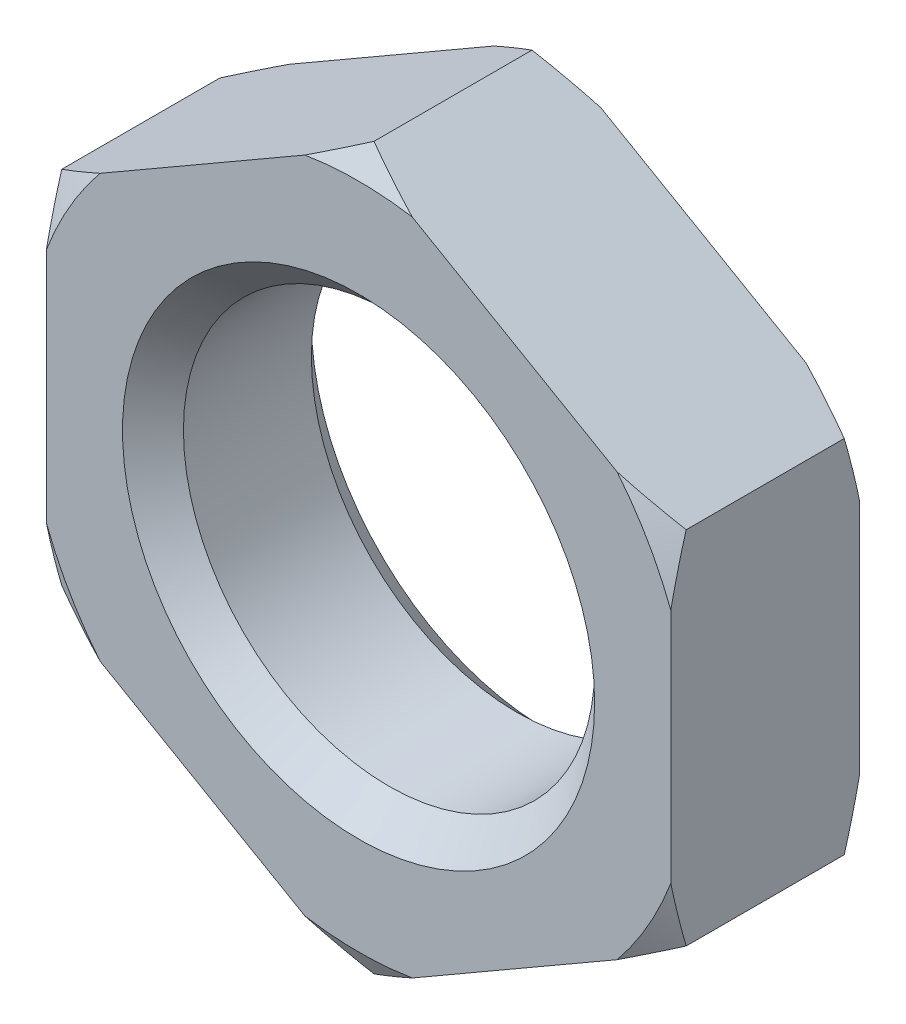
ISO-10303-21;
HEADER;
FILE_DESCRIPTION(('STEP AP214'),'2;1');
FILE_NAME('part.step','',(''),(''),'','','');
FILE_SCHEMA(('AUTOMOTIVE_DESIGN { 1 0 10303 214 1 1 1 1 }'));
ENDSEC;
DATA;
#1=APPLICATION_CONTEXT('core data for automotive mechanical design processes');
#2=APPLICATION_PROTOCOL_DEFINITION('international standard','automotive_design',2000,#1);
#3=PRODUCT_CONTEXT('',#1,'mechanical');
#4=PRODUCT('Part','Part','',(#3));
#5=PRODUCT_RELATED_PRODUCT_CATEGORY('part','',(#4));
#6=PRODUCT_DEFINITION_FORMATION('','',#4);
#7=PRODUCT_DEFINITION_CONTEXT('part definition',#1,'design');
#8=PRODUCT_DEFINITION('design','',#6,#7);
#9=PRODUCT_DEFINITION_SHAPE('','',#8);
#10=(LENGTH_UNIT() NAMED_UNIT(*) SI_UNIT(.MILLI.,.METRE.));
#11=(NAMED_UNIT(*) PLANE_ANGLE_UNIT() SI_UNIT($,.RADIAN.));
#12=(NAMED_UNIT(*) SI_UNIT($,.STERADIAN.) SOLID_ANGLE_UNIT());
#13=UNCERTAINTY_MEASURE_WITH_UNIT(LENGTH_MEASURE(1.E-05),#10,'distance_accuracy_value','');
#14=(GEOMETRIC_REPRESENTATION_CONTEXT(3) GLOBAL_UNCERTAINTY_ASSIGNED_CONTEXT((#13)) GLOBAL_UNIT_ASSIGNED_CONTEXT((#10,
#11,#12)) REPRESENTATION_CONTEXT('',''));
#15=CARTESIAN_POINT('',(0.,0.,0.));
#16=DIRECTION('',(0.,0.,1.));
#17=DIRECTION('',(1.,0.,0.));
#18=AXIS2_PLACEMENT_3D('',#15,#16,#17);
#19=CARTESIAN_POINT('',(0.,0.,-6.2));
#20=DIRECTION('',(0.,0.,1.));
#21=DIRECTION('',(1.,0.,0.));
#22=AXIS2_PLACEMENT_3D('',#19,#20,#21);
#23=PLANE('',#22);
#24=CARTESIAN_POINT('',(0.,0.,-6.2));
#25=DIRECTION('',(0.,0.,1.));
#26=DIRECTION('',(1.,0.,0.));
#27=AXIS2_PLACEMENT_3D('',#24,#25,#26);
#28=CIRCLE('',#27,15.5);
#29=CARTESIAN_POINT('',(15.5,0.,-6.2));
#30=VERTEX_POINT('',#29);
#31=EDGE_CURVE('E429',#30,#30,#28,.T.);
#32=ORIENTED_EDGE('',*,*,#31,.T.);
#33=EDGE_LOOP('',(#32));
#34=FACE_BOUND('',#33,.T.);
#35=DIRECTION('',(0.,1.,0.));
#36=VECTOR('',#35,1.);
#37=CARTESIAN_POINT('',(20.5,-11.8356805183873,-6.2));
#38=LINE('',#37,#36);
#39=CARTESIAN_POINT('',(20.5,-7.76505439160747,-6.2));
#40=VERTEX_POINT('',#39);
#41=CARTESIAN_POINT('',(20.5,7.76505439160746,-6.2));
#42=VERTEX_POINT('',#41);
#43=EDGE_CURVE('E362',#40,#42,#38,.T.);
#44=ORIENTED_EDGE('',*,*,#43,.F.);
#45=CARTESIAN_POINT('',(0.,0.,-6.2));
#46=DIRECTION('',(0.,0.,-1.));
#47=DIRECTION('',(-1.,0.,0.));
#48=AXIS2_PLACEMENT_3D('',#45,#46,#47);
#49=CIRCLE('',#48,21.9213610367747);
#50=CARTESIAN_POINT('',(16.9747343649,-13.8709935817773,-6.2));
#51=VERTEX_POINT('',#50);
#52=EDGE_CURVE('E352',#40,#51,#49,.T.);
#53=ORIENTED_EDGE('',*,*,#52,.T.);
#54=DIRECTION('',(0.866025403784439,0.5,0.));
#55=VECTOR('',#54,1.);
#56=CARTESIAN_POINT('',(0.,-23.6713610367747,-6.2));
#57=LINE('',#56,#55);
#58=CARTESIAN_POINT('',(3.52526563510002,-21.6360479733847,-6.2));
#59=VERTEX_POINT('',#58);
#60=EDGE_CURVE('E372',#59,#51,#57,.T.);
#61=ORIENTED_EDGE('',*,*,#60,.F.);
#62=CARTESIAN_POINT('',(-3.52526563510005,-21.6360479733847,-6.2));
#63=VERTEX_POINT('',#62);
#64=EDGE_CURVE('E347',#59,#63,#49,.T.);
#65=ORIENTED_EDGE('',*,*,#64,.T.);
#66=DIRECTION('',(0.866025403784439,-0.5,0.));
#67=VECTOR('',#66,1.);
#68=CARTESIAN_POINT('',(-20.5,-11.8356805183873,-6.2));
#69=LINE('',#68,#67);
#70=CARTESIAN_POINT('',(-16.9747343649,-13.8709935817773,-6.2));
#71=VERTEX_POINT('',#70);
#72=EDGE_CURVE('E379',#71,#63,#69,.T.);
#73=ORIENTED_EDGE('',*,*,#72,.F.);
#74=CARTESIAN_POINT('',(-20.5,-7.76505439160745,-6.2));
#75=VERTEX_POINT('',#74);
#76=EDGE_CURVE('E340',#71,#75,#49,.T.);
#77=ORIENTED_EDGE('',*,*,#76,.T.);
#78=DIRECTION('',(0.,-1.,0.));
#79=VECTOR('',#78,1.);
#80=CARTESIAN_POINT('',(-20.5,11.8356805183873,-6.2));
#81=LINE('',#80,#79);
#82=CARTESIAN_POINT('',(-20.5,7.76505439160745,-6.2));
#83=VERTEX_POINT('',#82);
#84=EDGE_CURVE('E476',#83,#75,#81,.T.);
#85=ORIENTED_EDGE('',*,*,#84,.F.);
#86=CARTESIAN_POINT('',(-16.9747343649,13.8709935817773,-6.2));
#87=VERTEX_POINT('',#86);
#88=EDGE_CURVE('E63',#83,#87,#49,.T.);
#89=ORIENTED_EDGE('',*,*,#88,.T.);
#90=DIRECTION('',(-0.866025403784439,-0.5,0.));
#91=VECTOR('',#90,1.);
#92=CARTESIAN_POINT('',(0.,23.6713610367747,-6.2));
#93=LINE('',#92,#91);
#94=CARTESIAN_POINT('',(-3.52526563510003,21.6360479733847,-6.2));
#95=VERTEX_POINT('',#94);
#96=EDGE_CURVE('E181',#95,#87,#93,.T.);
#97=ORIENTED_EDGE('',*,*,#96,.F.);
#98=CARTESIAN_POINT('',(3.52526563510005,21.6360479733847,-6.2));
#99=VERTEX_POINT('',#98);
#100=EDGE_CURVE('E55',#95,#99,#49,.T.);
#101=ORIENTED_EDGE('',*,*,#100,.T.);
#102=DIRECTION('',(-0.866025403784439,0.5,0.));
#103=VECTOR('',#102,1.);
#104=CARTESIAN_POINT('',(20.5,11.8356805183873,-6.2));
#105=LINE('',#104,#103);
#106=CARTESIAN_POINT('',(16.9747343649,13.8709935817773,-6.2));
#107=VERTEX_POINT('',#106);
#108=EDGE_CURVE('E363',#107,#99,#105,.T.);
#109=ORIENTED_EDGE('',*,*,#108,.F.);
#110=EDGE_CURVE('E345',#107,#42,#49,.T.);
#111=ORIENTED_EDGE('',*,*,#110,.T.);
#112=EDGE_LOOP('',(#44,#53,#61,#65,#73,#77,#85,#89,#97,#101,#109,#111));
#113=FACE_BOUND('',#112,.T.);
#114=ADVANCED_FACE('F39',(#34,#113),#23,.F.);
#115=CARTESIAN_POINT('',(0.,0.,6.2));
#116=DIRECTION('',(0.,0.,1.));
#117=DIRECTION('',(1.,0.,0.));
#118=AXIS2_PLACEMENT_3D('',#115,#116,#117);
#119=PLANE('',#118);
#120=CARTESIAN_POINT('',(0.,0.,6.2));
#121=DIRECTION('',(0.,0.,1.));
#122=DIRECTION('',(1.,0.,0.));
#123=AXIS2_PLACEMENT_3D('',#120,#121,#122);
#124=CIRCLE('',#123,15.5);
#125=CARTESIAN_POINT('',(15.5,0.,6.2));
#126=VERTEX_POINT('',#125);
#127=EDGE_CURVE('E11',#126,#126,#124,.F.);
#128=ORIENTED_EDGE('',*,*,#127,.T.);
#129=EDGE_LOOP('',(#128));
#130=FACE_BOUND('',#129,.T.);
#131=CARTESIAN_POINT('',(0.,0.,6.2));
#132=DIRECTION('',(0.,0.,-1.));
#133=DIRECTION('',(-1.,0.,0.));
#134=AXIS2_PLACEMENT_3D('',#131,#132,#133);
#135=CIRCLE('',#134,21.9213610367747);
#136=CARTESIAN_POINT('',(20.5,-7.76505439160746,6.2));
#137=VERTEX_POINT('',#136);
#138=CARTESIAN_POINT('',(16.9747343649,-13.8709935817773,6.2));
#139=VERTEX_POINT('',#138);
#140=EDGE_CURVE('E315',#137,#139,#135,.T.);
#141=ORIENTED_EDGE('',*,*,#140,.F.);
#142=DIRECTION('',(0.,1.,0.));
#143=VECTOR('',#142,1.);
#144=CARTESIAN_POINT('',(20.5,-11.8356805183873,6.2));
#145=LINE('',#144,#143);
#146=CARTESIAN_POINT('',(20.5,7.76505439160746,6.2));
#147=VERTEX_POINT('',#146);
#148=EDGE_CURVE('E386',#137,#147,#145,.T.);
#149=ORIENTED_EDGE('',*,*,#148,.T.);
#150=CARTESIAN_POINT('',(16.9747343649,13.8709935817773,6.2));
#151=VERTEX_POINT('',#150);
#152=EDGE_CURVE('E307',#151,#147,#135,.T.);
#153=ORIENTED_EDGE('',*,*,#152,.F.);
#154=DIRECTION('',(-0.866025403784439,0.5,0.));
#155=VECTOR('',#154,1.);
#156=CARTESIAN_POINT('',(20.5,11.8356805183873,6.2));
#157=LINE('',#156,#155);
#158=CARTESIAN_POINT('',(3.52526563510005,21.6360479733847,6.2));
#159=VERTEX_POINT('',#158);
#160=EDGE_CURVE('E371',#151,#159,#157,.T.);
#161=ORIENTED_EDGE('',*,*,#160,.T.);
#162=CARTESIAN_POINT('',(-3.52526563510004,21.6360479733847,6.2));
#163=VERTEX_POINT('',#162);
#164=EDGE_CURVE('E297',#163,#159,#135,.T.);
#165=ORIENTED_EDGE('',*,*,#164,.F.);
#166=DIRECTION('',(-0.866025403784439,-0.5,0.));
#167=VECTOR('',#166,1.);
#168=CARTESIAN_POINT('',(0.,23.6713610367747,6.2));
#169=LINE('',#168,#167);
#170=CARTESIAN_POINT('',(-16.9747343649,13.8709935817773,6.2));
#171=VERTEX_POINT('',#170);
#172=EDGE_CURVE('E377',#163,#171,#169,.T.);
#173=ORIENTED_EDGE('',*,*,#172,.T.);
#174=CARTESIAN_POINT('',(-20.5,7.76505439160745,6.2));
#175=VERTEX_POINT('',#174);
#176=EDGE_CURVE('E295',#175,#171,#135,.T.);
#177=ORIENTED_EDGE('',*,*,#176,.F.);
#178=DIRECTION('',(0.,-1.,0.));
#179=VECTOR('',#178,1.);
#180=CARTESIAN_POINT('',(-20.5,11.8356805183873,6.2));
#181=LINE('',#180,#179);
#182=CARTESIAN_POINT('',(-20.5,-7.76505439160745,6.2));
#183=VERTEX_POINT('',#182);
#184=EDGE_CURVE('E523',#175,#183,#181,.T.);
#185=ORIENTED_EDGE('',*,*,#184,.T.);
#186=CARTESIAN_POINT('',(-16.9747343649,-13.8709935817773,6.2));
#187=VERTEX_POINT('',#186);
#188=EDGE_CURVE('E298',#187,#183,#135,.T.);
#189=ORIENTED_EDGE('',*,*,#188,.F.);
#190=DIRECTION('',(0.866025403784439,-0.5,0.));
#191=VECTOR('',#190,1.);
#192=CARTESIAN_POINT('',(-20.5,-11.8356805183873,6.2));
#193=LINE('',#192,#191);
#194=CARTESIAN_POINT('',(-3.52526563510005,-21.6360479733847,6.2));
#195=VERTEX_POINT('',#194);
#196=EDGE_CURVE('E469',#187,#195,#193,.T.);
#197=ORIENTED_EDGE('',*,*,#196,.T.);
#198=CARTESIAN_POINT('',(3.52526563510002,-21.6360479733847,6.2));
#199=VERTEX_POINT('',#198);
#200=EDGE_CURVE('E309',#199,#195,#135,.T.);
#201=ORIENTED_EDGE('',*,*,#200,.F.);
#202=DIRECTION('',(0.866025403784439,0.5,0.));
#203=VECTOR('',#202,1.);
#204=CARTESIAN_POINT('',(0.,-23.6713610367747,6.2));
#205=LINE('',#204,#203);
#206=EDGE_CURVE('E466',#199,#139,#205,.T.);
#207=ORIENTED_EDGE('',*,*,#206,.T.);
#208=EDGE_LOOP('',(#141,#149,#153,#161,#165,#173,#177,#185,#189,#197,#201,#207));
#209=FACE_BOUND('',#208,.T.);
#210=ADVANCED_FACE('F420',(#130,#209),#119,.T.);
#211=CARTESIAN_POINT('',(20.5,11.8356805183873,6.2));
#212=DIRECTION('',(-0.5,-0.866025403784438,0.));
#213=DIRECTION('',(0.866025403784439,-0.5,0.));
#214=AXIS2_PLACEMENT_3D('',#211,#212,#213);
#215=PLANE('',#214);
#216=DIRECTION('',(0.,0.,-1.));
#217=VECTOR('',#216,1.);
#218=CARTESIAN_POINT('',(20.5,11.8356805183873,6.2));
#219=LINE('',#218,#217);
#220=CARTESIAN_POINT('',(20.5,11.8356805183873,5.18963702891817));
#221=VERTEX_POINT('',#220);
#222=CARTESIAN_POINT('',(20.5,11.8356805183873,-5.18963702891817));
#223=VERTEX_POINT('',#222);
#224=EDGE_CURVE('E383',#221,#223,#219,.T.);
#225=ORIENTED_EDGE('',*,*,#224,.T.);
#226=CARTESIAN_POINT('',(34.7159483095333,3.62809893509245,1.29611691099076));
#227=CARTESIAN_POINT('',(34.3939651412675,3.81399600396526,1.12238550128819));
#228=CARTESIAN_POINT('',(34.0715913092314,4.00011862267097,0.949620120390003));
#229=CARTESIAN_POINT('',(33.4259938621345,4.37285448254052,0.606210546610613));
#230=CARTESIAN_POINT('',(33.1027702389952,4.55946772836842,0.435566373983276));
#231=CARTESIAN_POINT('',(32.1316555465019,5.12014105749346,-0.0729353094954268));
#232=CARTESIAN_POINT('',(31.4823959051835,5.49499128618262,-0.407321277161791));
#233=CARTESIAN_POINT('',(30.1775540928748,6.24834205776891,-1.06601041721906));
#234=CARTESIAN_POINT('',(29.5219583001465,6.62685046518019,-1.3902776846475));
#235=CARTESIAN_POINT('',(28.205850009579,7.38670594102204,-2.02519855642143));
#236=CARTESIAN_POINT('',(27.5453376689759,7.76805291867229,-2.33585259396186));
#237=CARTESIAN_POINT('',(26.2018052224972,8.54374173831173,-2.94821897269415));
#238=CARTESIAN_POINT('',(25.5186388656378,8.9381680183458,-3.24950532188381));
#239=CARTESIAN_POINT('',(24.1454037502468,9.73100568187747,-3.83057482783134));
#240=CARTESIAN_POINT('',(23.4553346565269,10.1294172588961,-4.11035693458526));
#241=CARTESIAN_POINT('',(22.0681689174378,10.9302977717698,-4.64307819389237));
#242=CARTESIAN_POINT('',(21.3710797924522,11.3327623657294,-4.89604329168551));
#243=CARTESIAN_POINT('',(19.9686224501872,12.1424714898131,-5.369295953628));
#244=CARTESIAN_POINT('',(19.263255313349,12.5497153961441,-5.58958773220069));
#245=CARTESIAN_POINT('',(18.0650087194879,13.2415233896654,-5.92802179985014));
#246=CARTESIAN_POINT('',(17.5743428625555,13.5248094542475,-6.05661440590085));
#247=CARTESIAN_POINT('',(16.5891637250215,14.0936028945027,-6.292489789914));
#248=CARTESIAN_POINT('',(16.0946505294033,14.3791102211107,-6.3997730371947));
#249=CARTESIAN_POINT('',(15.1023089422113,14.9520389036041,-6.59060017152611));
#250=CARTESIAN_POINT('',(14.604481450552,15.2394597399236,-6.67415025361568));
#251=CARTESIAN_POINT('',(13.606062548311,15.8158971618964,-6.81539660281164));
#252=CARTESIAN_POINT('',(13.1054711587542,16.104913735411,-6.87309306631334));
#253=CARTESIAN_POINT('',(12.1082744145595,16.6806455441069,-6.96047318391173));
#254=CARTESIAN_POINT('',(11.6116900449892,16.9673486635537,-6.99047354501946));
#255=CARTESIAN_POINT('',(10.617847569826,17.5411438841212,-7.02270768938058));
#256=CARTESIAN_POINT('',(10.1205894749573,17.8282359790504,-7.02494190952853));
#257=CARTESIAN_POINT('',(9.12653939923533,18.4021510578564,-7.00157311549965));
#258=CARTESIAN_POINT('',(8.62974744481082,18.6889740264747,-6.97596860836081));
#259=CARTESIAN_POINT('',(7.63776835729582,19.2616934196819,-6.89769844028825));
#260=CARTESIAN_POINT('',(7.14258129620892,19.5475898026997,-6.84503158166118));
#261=CARTESIAN_POINT('',(5.97204769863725,20.2233976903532,-6.68988326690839));
#262=CARTESIAN_POINT('',(5.2978079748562,20.6126701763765,-6.5761819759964));
#263=CARTESIAN_POINT('',(3.95578379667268,21.3874881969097,-6.30605245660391));
#264=CARTESIAN_POINT('',(3.28800043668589,21.7730330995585,-6.14961711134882));
#265=CARTESIAN_POINT('',(1.95905957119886,22.5402974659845,-5.79994889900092));
#266=CARTESIAN_POINT('',(1.297909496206,22.9220126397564,-5.60667876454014));
#267=CARTESIAN_POINT('',(-0.0169849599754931,23.6811673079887,-5.18940861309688));
#268=CARTESIAN_POINT('',(-0.670729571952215,24.0586069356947,-4.96540955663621));
#269=CARTESIAN_POINT('',(-1.97876947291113,24.8138041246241,-4.48926470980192));
#270=CARTESIAN_POINT('',(-2.63298336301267,25.1915146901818,-4.23682284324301));
#271=CARTESIAN_POINT('',(-3.9349175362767,25.943186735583,-3.71062027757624));
#272=CARTESIAN_POINT('',(-4.58263776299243,26.3171481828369,-3.43685939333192));
#273=CARTESIAN_POINT('',(-5.87197244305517,27.0615459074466,-2.87201224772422));
#274=CARTESIAN_POINT('',(-6.51358992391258,27.4319839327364,-2.58093515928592));
#275=CARTESIAN_POINT('',(-7.79177266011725,28.1699430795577,-1.98443661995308));
#276=CARTESIAN_POINT('',(-8.42833802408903,28.5374642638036,-1.67901547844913));
#277=CARTESIAN_POINT('',(-9.49802445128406,29.1550480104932,-1.15400832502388));
#278=CARTESIAN_POINT('',(-9.93230578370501,29.4057804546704,-0.937560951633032));
#279=CARTESIAN_POINT('',(-10.7989866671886,29.9061588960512,-0.499744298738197));
#280=CARTESIAN_POINT('',(-11.2313862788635,30.1558049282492,-0.278375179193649));
#281=CARTESIAN_POINT('',(-12.0899927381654,30.6515215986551,0.166378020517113));
#282=CARTESIAN_POINT('',(-12.5162171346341,30.8976023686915,0.389716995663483));
#283=CARTESIAN_POINT('',(-13.3671691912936,31.3888997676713,0.840188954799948));
#284=CARTESIAN_POINT('',(-13.7918968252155,31.6341163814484,1.0673220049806));
#285=CARTESIAN_POINT('',(-14.2159483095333,31.8789426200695,1.29611691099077));
#286=B_SPLINE_CURVE_WITH_KNOTS('',3,(#226,#227,#228,#229,#230,#231,#232,#233,#234,#235,#236,
#237,#238,#239,#240,#241,#242,#243,#244,#245,#246,#247,#248,#249,#250,#251,#252,#253,#254,#255,
#256,#257,#258,#259,#260,#261,#262,#263,#264,#265,#266,#267,#268,#269,#270,#271,#272,#273,#274,
#275,#276,#277,#278,#279,#280,#281,#282,#283,#284,#285),.UNSPECIFIED.,.F.,.F.,(4,2,2,2,2,2,2,2,
2,2,2,2,2,2,2,2,2,2,2,2,2,2,2,2,2,2,2,2,2,4),(0.,1.23114376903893,2.46229928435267,
4.92489816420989,7.39542083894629,9.86586484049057,12.3989032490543,14.9320652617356,
17.4627536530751,19.9931153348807,21.735713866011,23.4782740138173,25.2203788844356,
26.9624705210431,28.6843851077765,30.406272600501,32.1282524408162,33.8503084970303,
36.2092914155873,38.5686674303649,40.9304433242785,43.2921454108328,45.6812139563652,
48.0703032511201,50.4581380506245,52.8459213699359,54.4844465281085,56.1229185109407,
57.7442994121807,59.365708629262),.UNSPECIFIED.);
#287=EDGE_CURVE('E319',#223,#107,#286,.T.);
#288=ORIENTED_EDGE('',*,*,#287,.T.);
#289=ORIENTED_EDGE('',*,*,#108,.T.);
#290=CARTESIAN_POINT('',(0.,23.6713610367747,-5.18963702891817));
#291=VERTEX_POINT('',#290);
#292=EDGE_CURVE('E310',#99,#291,#286,.T.);
#293=ORIENTED_EDGE('',*,*,#292,.T.);
#294=DIRECTION('',(0.,0.,-1.));
#295=VECTOR('',#294,1.);
#296=CARTESIAN_POINT('',(0.,23.6713610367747,6.2));
#297=LINE('',#296,#295);
#298=CARTESIAN_POINT('',(0.,23.6713610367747,5.18963702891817));
#299=VERTEX_POINT('',#298);
#300=EDGE_CURVE('E190',#299,#291,#297,.T.);
#301=ORIENTED_EDGE('',*,*,#300,.F.);
#302=CARTESIAN_POINT('',(-14.2159483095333,31.8789426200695,-1.29611691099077));
#303=CARTESIAN_POINT('',(-13.8939651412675,31.6930455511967,-1.1223855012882));
#304=CARTESIAN_POINT('',(-13.5715913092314,31.506922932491,-0.949620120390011));
#305=CARTESIAN_POINT('',(-12.9259938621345,31.1341870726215,-0.606210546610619));
#306=CARTESIAN_POINT('',(-12.6027702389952,30.9475738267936,-0.435566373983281));
#307=CARTESIAN_POINT('',(-11.6316555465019,30.3869004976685,0.0729353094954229));
#308=CARTESIAN_POINT('',(-10.9823959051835,30.0120502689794,0.407321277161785));
#309=CARTESIAN_POINT('',(-9.67755409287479,29.2586994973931,1.06601041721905));
#310=CARTESIAN_POINT('',(-9.02195830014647,28.8801910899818,1.39027768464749));
#311=CARTESIAN_POINT('',(-7.70585000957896,28.12033561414,2.02519855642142));
#312=CARTESIAN_POINT('',(-7.04533766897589,27.7389886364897,2.33585259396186));
#313=CARTESIAN_POINT('',(-5.70180522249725,26.9632998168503,2.94821897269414));
#314=CARTESIAN_POINT('',(-5.01863886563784,26.5688735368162,3.2495053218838));
#315=CARTESIAN_POINT('',(-3.64540375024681,25.7760358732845,3.83057482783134));
#316=CARTESIAN_POINT('',(-2.9553346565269,25.3776242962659,4.11035693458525));
#317=CARTESIAN_POINT('',(-1.56816891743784,24.5767437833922,4.64307819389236));
#318=CARTESIAN_POINT('',(-0.87107979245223,24.1742791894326,4.8960432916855));
#319=CARTESIAN_POINT('',(0.531377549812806,23.3645700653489,5.36929595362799));
#320=CARTESIAN_POINT('',(1.23674468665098,22.9573261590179,5.58958773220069));
#321=CARTESIAN_POINT('',(2.43499128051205,22.2655181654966,5.92802179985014));
#322=CARTESIAN_POINT('',(2.92565713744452,21.9822321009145,6.05661440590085));
#323=CARTESIAN_POINT('',(3.91083627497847,21.4134386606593,6.29248978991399));
#324=CARTESIAN_POINT('',(4.40534947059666,21.1279313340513,6.39977303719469));
#325=CARTESIAN_POINT('',(5.39769105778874,20.5550026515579,6.59060017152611));
#326=CARTESIAN_POINT('',(5.89551854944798,20.2675818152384,6.67415025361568));
#327=CARTESIAN_POINT('',(6.89393745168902,19.6911443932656,6.81539660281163));
#328=CARTESIAN_POINT('',(7.39452884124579,19.402127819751,6.87309306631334));
#329=CARTESIAN_POINT('',(8.39172558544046,18.8263960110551,6.96047318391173));
#330=CARTESIAN_POINT('',(8.88830995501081,18.5396928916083,6.99047354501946));
#331=CARTESIAN_POINT('',(9.88215243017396,17.9658976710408,7.02270768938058));
#332=CARTESIAN_POINT('',(10.3794105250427,17.6788055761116,7.02494190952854));
#333=CARTESIAN_POINT('',(11.3734606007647,17.1048904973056,7.00157311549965));
#334=CARTESIAN_POINT('',(11.8702525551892,16.8180675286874,6.97596860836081));
#335=CARTESIAN_POINT('',(12.8622316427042,16.2453481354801,6.89769844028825));
#336=CARTESIAN_POINT('',(13.3574187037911,15.9594517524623,6.84503158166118));
#337=CARTESIAN_POINT('',(14.5279523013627,15.2836438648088,6.6898832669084));
#338=CARTESIAN_POINT('',(15.2021920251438,14.8943713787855,6.5761819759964));
#339=CARTESIAN_POINT('',(16.5442162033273,14.1195533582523,6.30605245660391));
#340=CARTESIAN_POINT('',(17.2119995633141,13.7340084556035,6.14961711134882));
#341=CARTESIAN_POINT('',(18.5409404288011,12.9667440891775,5.79994889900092));
#342=CARTESIAN_POINT('',(19.202090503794,12.5850289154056,5.60667876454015));
#343=CARTESIAN_POINT('',(20.5169849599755,11.8258742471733,5.18940861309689));
#344=CARTESIAN_POINT('',(21.1707295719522,11.4484346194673,4.96540955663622));
#345=CARTESIAN_POINT('',(22.4787694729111,10.6932374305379,4.48926470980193));
#346=CARTESIAN_POINT('',(23.1329833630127,10.3155268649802,4.23682284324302));
#347=CARTESIAN_POINT('',(24.4349175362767,9.563854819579,3.71062027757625));
#348=CARTESIAN_POINT('',(25.0826377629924,9.18989337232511,3.43685939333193));
#349=CARTESIAN_POINT('',(26.3719724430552,8.44549564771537,2.87201224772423));
#350=CARTESIAN_POINT('',(27.0135899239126,8.07505762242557,2.58093515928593));
#351=CARTESIAN_POINT('',(28.2917726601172,7.33709847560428,1.98443661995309));
#352=CARTESIAN_POINT('',(28.928338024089,6.96957729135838,1.67901547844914));
#353=CARTESIAN_POINT('',(29.998024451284,6.35199354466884,1.1540083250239));
#354=CARTESIAN_POINT('',(30.432305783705,6.10126110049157,0.937560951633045));
#355=CARTESIAN_POINT('',(31.2989866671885,5.60088265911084,0.499744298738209));
#356=CARTESIAN_POINT('',(31.7313862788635,5.3512366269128,0.278375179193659));
#357=CARTESIAN_POINT('',(32.5899927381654,4.85551995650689,-0.166378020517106));
#358=CARTESIAN_POINT('',(33.0162171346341,4.60943918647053,-0.389716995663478));
#359=CARTESIAN_POINT('',(33.8671691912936,4.11814178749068,-0.840188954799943));
#360=CARTESIAN_POINT('',(34.2918968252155,3.87292517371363,-1.0673220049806));
#361=CARTESIAN_POINT('',(34.7159483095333,3.62809893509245,-1.29611691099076));
#362=B_SPLINE_CURVE_WITH_KNOTS('',3,(#302,#303,#304,#305,#306,#307,#308,#309,#310,#311,#312,
#313,#314,#315,#316,#317,#318,#319,#320,#321,#322,#323,#324,#325,#326,#327,#328,#329,#330,#331,
#332,#333,#334,#335,#336,#337,#338,#339,#340,#341,#342,#343,#344,#345,#346,#347,#348,#349,#350,
#351,#352,#353,#354,#355,#356,#357,#358,#359,#360,#361),.UNSPECIFIED.,.F.,.F.,(4,2,2,2,2,2,2,2,
2,2,2,2,2,2,2,2,2,2,2,2,2,2,2,2,2,2,2,2,2,4),(0.,1.23114376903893,2.46229928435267,
4.92489816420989,7.39542083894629,9.86586484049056,12.3989032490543,14.9320652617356,
17.4627536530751,19.9931153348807,21.735713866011,23.4782740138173,25.2203788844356,
26.9624705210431,28.6843851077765,30.406272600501,32.1282524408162,33.8503084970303,
36.2092914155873,38.5686674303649,40.9304433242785,43.2921454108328,45.6812139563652,
48.0703032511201,50.4581380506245,52.8459213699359,54.4844465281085,56.1229185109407,
57.7442994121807,59.365708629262),.UNSPECIFIED.);
#363=EDGE_CURVE('E474',#299,#159,#362,.T.);
#364=ORIENTED_EDGE('',*,*,#363,.T.);
#365=ORIENTED_EDGE('',*,*,#160,.F.);
#366=EDGE_CURVE('E248',#151,#221,#362,.T.);
#367=ORIENTED_EDGE('',*,*,#366,.T.);
#368=EDGE_LOOP('',(#225,#288,#289,#293,#301,#364,#365,#367));
#369=FACE_BOUND('',#368,.T.);
#370=ADVANCED_FACE('F425',(#369),#215,.F.);
#371=CARTESIAN_POINT('',(0.,23.6713610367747,6.2));
#372=DIRECTION('',(0.5,-0.866025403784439,0.));
#373=DIRECTION('',(0.866025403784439,0.5,0.));
#374=AXIS2_PLACEMENT_3D('',#371,#372,#373);
#375=PLANE('',#374);
#376=ORIENTED_EDGE('',*,*,#300,.T.);
#377=CARTESIAN_POINT('',(14.2159483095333,31.8789426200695,1.29611691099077));
#378=CARTESIAN_POINT('',(13.8939651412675,31.6930455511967,1.1223855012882));
#379=CARTESIAN_POINT('',(13.5715913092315,31.506922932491,0.949620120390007));
#380=CARTESIAN_POINT('',(12.9259938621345,31.1341870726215,0.606210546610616));
#381=CARTESIAN_POINT('',(12.6027702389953,30.9475738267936,0.435566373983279));
#382=CARTESIAN_POINT('',(11.6316555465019,30.3869004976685,-0.0729353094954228));
#383=CARTESIAN_POINT('',(10.9823959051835,30.0120502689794,-0.407321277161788));
#384=CARTESIAN_POINT('',(9.6775540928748,29.2586994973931,-1.06601041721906));
#385=CARTESIAN_POINT('',(9.02195830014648,28.8801910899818,-1.39027768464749));
#386=CARTESIAN_POINT('',(7.70585000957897,28.12033561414,-2.02519855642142));
#387=CARTESIAN_POINT('',(7.0453376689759,27.7389886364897,-2.33585259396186));
#388=CARTESIAN_POINT('',(5.70180522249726,26.9632998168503,-2.94821897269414));
#389=CARTESIAN_POINT('',(5.01863886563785,26.5688735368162,-3.24950532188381));
#390=CARTESIAN_POINT('',(3.64540375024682,25.7760358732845,-3.83057482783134));
#391=CARTESIAN_POINT('',(2.95533465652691,25.3776242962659,-4.11035693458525));
#392=CARTESIAN_POINT('',(1.56816891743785,24.5767437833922,-4.64307819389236));
#393=CARTESIAN_POINT('',(0.871079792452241,24.1742791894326,-4.8960432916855));
#394=CARTESIAN_POINT('',(-0.531377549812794,23.3645700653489,-5.36929595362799));
#395=CARTESIAN_POINT('',(-1.23674468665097,22.9573261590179,-5.58958773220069));
#396=CARTESIAN_POINT('',(-2.43499128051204,22.2655181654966,-5.92802179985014));
#397=CARTESIAN_POINT('',(-2.92565713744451,21.9822321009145,-6.05661440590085));
#398=CARTESIAN_POINT('',(-3.91083627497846,21.4134386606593,-6.29248978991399));
#399=CARTESIAN_POINT('',(-4.40534947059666,21.1279313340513,-6.39977303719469));
#400=CARTESIAN_POINT('',(-5.39769105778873,20.5550026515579,-6.5906001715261));
#401=CARTESIAN_POINT('',(-5.89551854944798,20.2675818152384,-6.67415025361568));
#402=CARTESIAN_POINT('',(-6.89393745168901,19.6911443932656,-6.81539660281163));
#403=CARTESIAN_POINT('',(-7.39452884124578,19.402127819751,-6.87309306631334));
#404=CARTESIAN_POINT('',(-8.39172558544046,18.8263960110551,-6.96047318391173));
#405=CARTESIAN_POINT('',(-8.88830995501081,18.5396928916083,-6.99047354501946));
#406=CARTESIAN_POINT('',(-9.88215243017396,17.9658976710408,-7.02270768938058));
#407=CARTESIAN_POINT('',(-10.3794105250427,17.6788055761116,-7.02494190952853));
#408=CARTESIAN_POINT('',(-11.3734606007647,17.1048904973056,-7.00157311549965));
#409=CARTESIAN_POINT('',(-11.8702525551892,16.8180675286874,-6.97596860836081));
#410=CARTESIAN_POINT('',(-12.8622316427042,16.2453481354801,-6.89769844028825));
#411=CARTESIAN_POINT('',(-13.3574187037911,15.9594517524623,-6.84503158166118));
#412=CARTESIAN_POINT('',(-14.5279523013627,15.2836438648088,-6.68988326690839));
#413=CARTESIAN_POINT('',(-15.2021920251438,14.8943713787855,-6.5761819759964));
#414=CARTESIAN_POINT('',(-16.5442162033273,14.1195533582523,-6.30605245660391));
#415=CARTESIAN_POINT('',(-17.2119995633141,13.7340084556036,-6.14961711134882));
#416=CARTESIAN_POINT('',(-18.5409404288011,12.9667440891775,-5.79994889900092));
#417=CARTESIAN_POINT('',(-19.202090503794,12.5850289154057,-5.60667876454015));
#418=CARTESIAN_POINT('',(-20.5169849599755,11.8258742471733,-5.18940861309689));
#419=CARTESIAN_POINT('',(-21.1707295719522,11.4484346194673,-4.96540955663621));
#420=CARTESIAN_POINT('',(-22.4787694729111,10.6932374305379,-4.48926470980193));
#421=CARTESIAN_POINT('',(-23.1329833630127,10.3155268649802,-4.23682284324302));
#422=CARTESIAN_POINT('',(-24.4349175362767,9.56385481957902,-3.71062027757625));
#423=CARTESIAN_POINT('',(-25.0826377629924,9.18989337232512,-3.43685939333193));
#424=CARTESIAN_POINT('',(-26.3719724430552,8.44549564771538,-2.87201224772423));
#425=CARTESIAN_POINT('',(-27.0135899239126,8.07505762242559,-2.58093515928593));
#426=CARTESIAN_POINT('',(-28.2917726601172,7.33709847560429,-1.98443661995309));
#427=CARTESIAN_POINT('',(-28.928338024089,6.9695772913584,-1.67901547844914));
#428=CARTESIAN_POINT('',(-29.998024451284,6.35199354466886,-1.15400832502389));
#429=CARTESIAN_POINT('',(-30.432305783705,6.10126110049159,-0.937560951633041));
#430=CARTESIAN_POINT('',(-31.2989866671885,5.60088265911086,-0.499744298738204));
#431=CARTESIAN_POINT('',(-31.7313862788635,5.35123662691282,-0.278375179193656));
#432=CARTESIAN_POINT('',(-32.5899927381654,4.85551995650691,0.166378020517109));
#433=CARTESIAN_POINT('',(-33.0162171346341,4.60943918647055,0.389716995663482));
#434=CARTESIAN_POINT('',(-33.8671691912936,4.11814178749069,0.840188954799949));
#435=CARTESIAN_POINT('',(-34.2918968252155,3.87292517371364,1.0673220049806));
#436=CARTESIAN_POINT('',(-34.7159483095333,3.62809893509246,1.29611691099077));
#437=B_SPLINE_CURVE_WITH_KNOTS('',3,(#377,#378,#379,#380,#381,#382,#383,#384,#385,#386,#387,
#388,#389,#390,#391,#392,#393,#394,#395,#396,#397,#398,#399,#400,#401,#402,#403,#404,#405,#406,
#407,#408,#409,#410,#411,#412,#413,#414,#415,#416,#417,#418,#419,#420,#421,#422,#423,#424,#425,
#426,#427,#428,#429,#430,#431,#432,#433,#434,#435,#436),.UNSPECIFIED.,.F.,.F.,(4,2,2,2,2,2,2,2,
2,2,2,2,2,2,2,2,2,2,2,2,2,2,2,2,2,2,2,2,2,4),(0.,1.23114376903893,2.46229928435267,
4.92489816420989,7.39542083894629,9.86586484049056,12.3989032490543,14.9320652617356,
17.4627536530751,19.9931153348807,21.735713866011,23.4782740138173,25.2203788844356,
26.9624705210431,28.6843851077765,30.406272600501,32.1282524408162,33.8503084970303,
36.2092914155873,38.5686674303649,40.9304433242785,43.2921454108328,45.6812139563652,
48.0703032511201,50.4581380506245,52.8459213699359,54.4844465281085,56.1229185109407,
57.7442994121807,59.365708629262),.UNSPECIFIED.);
#438=EDGE_CURVE('E183',#291,#95,#437,.T.);
#439=ORIENTED_EDGE('',*,*,#438,.T.);
#440=ORIENTED_EDGE('',*,*,#96,.T.);
#441=CARTESIAN_POINT('',(-20.5,11.8356805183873,-5.18963702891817));
#442=VERTEX_POINT('',#441);
#443=EDGE_CURVE('E165',#87,#442,#437,.T.);
#444=ORIENTED_EDGE('',*,*,#443,.T.);
#445=DIRECTION('',(0.,0.,-1.));
#446=VECTOR('',#445,1.);
#447=CARTESIAN_POINT('',(-20.5,11.8356805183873,6.2));
#448=LINE('',#447,#446);
#449=CARTESIAN_POINT('',(-20.5,11.8356805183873,5.18963702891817));
#450=VERTEX_POINT('',#449);
#451=EDGE_CURVE('E179',#450,#442,#448,.T.);
#452=ORIENTED_EDGE('',*,*,#451,.F.);
#453=CARTESIAN_POINT('',(-34.7159483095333,3.62809893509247,-1.29611691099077));
#454=CARTESIAN_POINT('',(-34.3939651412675,3.81399600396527,-1.1223855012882));
#455=CARTESIAN_POINT('',(-34.0715913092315,4.00011862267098,-0.94962012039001));
#456=CARTESIAN_POINT('',(-33.4259938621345,4.37285448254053,-0.606210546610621));
#457=CARTESIAN_POINT('',(-33.1027702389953,4.55946772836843,-0.435566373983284));
#458=CARTESIAN_POINT('',(-32.1316555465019,5.12014105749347,0.0729353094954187));
#459=CARTESIAN_POINT('',(-31.4823959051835,5.49499128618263,0.407321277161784));
#460=CARTESIAN_POINT('',(-30.1775540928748,6.24834205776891,1.06601041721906));
#461=CARTESIAN_POINT('',(-29.5219583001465,6.6268504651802,1.39027768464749));
#462=CARTESIAN_POINT('',(-28.205850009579,7.38670594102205,2.02519855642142));
#463=CARTESIAN_POINT('',(-27.5453376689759,7.7680529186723,2.33585259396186));
#464=CARTESIAN_POINT('',(-26.2018052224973,8.54374173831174,2.94821897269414));
#465=CARTESIAN_POINT('',(-25.5186388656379,8.93816801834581,3.2495053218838));
#466=CARTESIAN_POINT('',(-24.1454037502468,9.73100568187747,3.83057482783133));
#467=CARTESIAN_POINT('',(-23.4553346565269,10.1294172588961,4.11035693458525));
#468=CARTESIAN_POINT('',(-22.0681689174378,10.9302977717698,4.64307819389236));
#469=CARTESIAN_POINT('',(-21.3710797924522,11.3327623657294,4.8960432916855));
#470=CARTESIAN_POINT('',(-19.9686224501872,12.1424714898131,5.36929595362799));
#471=CARTESIAN_POINT('',(-19.263255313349,12.5497153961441,5.58958773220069));
#472=CARTESIAN_POINT('',(-18.065008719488,13.2415233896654,5.92802179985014));
#473=CARTESIAN_POINT('',(-17.5743428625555,13.5248094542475,6.05661440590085));
#474=CARTESIAN_POINT('',(-16.5891637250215,14.0936028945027,6.29248978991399));
#475=CARTESIAN_POINT('',(-16.0946505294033,14.3791102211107,6.39977303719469));
#476=CARTESIAN_POINT('',(-15.1023089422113,14.9520389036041,6.5906001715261));
#477=CARTESIAN_POINT('',(-14.604481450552,15.2394597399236,6.67415025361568));
#478=CARTESIAN_POINT('',(-13.606062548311,15.8158971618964,6.81539660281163));
#479=CARTESIAN_POINT('',(-13.1054711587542,16.104913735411,6.87309306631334));
#480=CARTESIAN_POINT('',(-12.1082744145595,16.6806455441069,6.96047318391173));
#481=CARTESIAN_POINT('',(-11.6116900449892,16.9673486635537,6.99047354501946));
#482=CARTESIAN_POINT('',(-10.617847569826,17.5411438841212,7.02270768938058));
#483=CARTESIAN_POINT('',(-10.1205894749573,17.8282359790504,7.02494190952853));
#484=CARTESIAN_POINT('',(-9.12653939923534,18.4021510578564,7.00157311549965));
#485=CARTESIAN_POINT('',(-8.62974744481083,18.6889740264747,6.97596860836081));
#486=CARTESIAN_POINT('',(-7.63776835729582,19.2616934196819,6.89769844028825));
#487=CARTESIAN_POINT('',(-7.14258129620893,19.5475898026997,6.84503158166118));
#488=CARTESIAN_POINT('',(-5.97204769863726,20.2233976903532,6.68988326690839));
#489=CARTESIAN_POINT('',(-5.29780797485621,20.6126701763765,6.5761819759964));
#490=CARTESIAN_POINT('',(-3.95578379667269,21.3874881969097,6.30605245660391));
#491=CARTESIAN_POINT('',(-3.28800043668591,21.7730330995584,6.14961711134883));
#492=CARTESIAN_POINT('',(-1.95905957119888,22.5402974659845,5.79994889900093));
#493=CARTESIAN_POINT('',(-1.29790949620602,22.9220126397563,5.60667876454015));
#494=CARTESIAN_POINT('',(0.0169849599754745,23.6811673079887,5.18940861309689));
#495=CARTESIAN_POINT('',(0.670729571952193,24.0586069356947,4.96540955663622));
#496=CARTESIAN_POINT('',(1.9787694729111,24.8138041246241,4.48926470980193));
#497=CARTESIAN_POINT('',(2.63298336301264,25.1915146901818,4.23682284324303));
#498=CARTESIAN_POINT('',(3.93491753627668,25.943186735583,3.71062027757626));
#499=CARTESIAN_POINT('',(4.58263776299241,26.3171481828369,3.43685939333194));
#500=CARTESIAN_POINT('',(5.87197244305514,27.0615459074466,2.87201224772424));
#501=CARTESIAN_POINT('',(6.51358992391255,27.4319839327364,2.58093515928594));
#502=CARTESIAN_POINT('',(7.79177266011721,28.1699430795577,1.9844366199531));
#503=CARTESIAN_POINT('',(8.42833802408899,28.5374642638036,1.67901547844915));
#504=CARTESIAN_POINT('',(9.49802445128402,29.1550480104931,1.15400832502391));
#505=CARTESIAN_POINT('',(9.93230578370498,29.4057804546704,0.937560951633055));
#506=CARTESIAN_POINT('',(10.7989866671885,29.9061588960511,0.499744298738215));
#507=CARTESIAN_POINT('',(11.2313862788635,30.1558049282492,0.278375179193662));
#508=CARTESIAN_POINT('',(12.0899927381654,30.6515215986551,-0.166378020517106));
#509=CARTESIAN_POINT('',(12.5162171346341,30.8976023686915,-0.389716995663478));
#510=CARTESIAN_POINT('',(13.3671691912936,31.3888997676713,-0.840188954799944));
#511=CARTESIAN_POINT('',(13.7918968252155,31.6341163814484,-1.0673220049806));
#512=CARTESIAN_POINT('',(14.2159483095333,31.8789426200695,-1.29611691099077));
#513=B_SPLINE_CURVE_WITH_KNOTS('',3,(#453,#454,#455,#456,#457,#458,#459,#460,#461,#462,#463,
#464,#465,#466,#467,#468,#469,#470,#471,#472,#473,#474,#475,#476,#477,#478,#479,#480,#481,#482,
#483,#484,#485,#486,#487,#488,#489,#490,#491,#492,#493,#494,#495,#496,#497,#498,#499,#500,#501,
#502,#503,#504,#505,#506,#507,#508,#509,#510,#511,#512),.UNSPECIFIED.,.F.,.F.,(4,2,2,2,2,2,2,2,
2,2,2,2,2,2,2,2,2,2,2,2,2,2,2,2,2,2,2,2,2,4),(0.,1.23114376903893,2.46229928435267,
4.92489816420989,7.39542083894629,9.86586484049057,12.3989032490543,14.9320652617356,
17.4627536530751,19.9931153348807,21.735713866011,23.4782740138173,25.2203788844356,
26.9624705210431,28.6843851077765,30.406272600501,32.1282524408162,33.8503084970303,
36.2092914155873,38.5686674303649,40.9304433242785,43.2921454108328,45.6812139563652,
48.0703032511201,50.4581380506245,52.8459213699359,54.4844465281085,56.1229185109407,
57.7442994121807,59.365708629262),.UNSPECIFIED.);
#514=EDGE_CURVE('E268',#450,#171,#513,.T.);
#515=ORIENTED_EDGE('',*,*,#514,.T.);
#516=ORIENTED_EDGE('',*,*,#172,.F.);
#517=EDGE_CURVE('E480',#163,#299,#513,.T.);
#518=ORIENTED_EDGE('',*,*,#517,.T.);
#519=EDGE_LOOP('',(#376,#439,#440,#444,#452,#515,#516,#518));
#520=FACE_BOUND('',#519,.T.);
#521=ADVANCED_FACE('F177',(#520),#375,.F.);
#522=CARTESIAN_POINT('',(-20.5,11.8356805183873,6.2));
#523=DIRECTION('',(1.,0.,0.));
#524=DIRECTION('',(0.,1.,0.));
#525=AXIS2_PLACEMENT_3D('',#522,#523,#524);
#526=PLANE('',#525);
#527=ORIENTED_EDGE('',*,*,#451,.T.);
#528=CARTESIAN_POINT('',(-20.5,26.0516288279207,0.282987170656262));
#529=CARTESIAN_POINT('',(-20.5,25.6813749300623,0.11499907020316));
#530=CARTESIAN_POINT('',(-20.5,25.3106088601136,-0.0518592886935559));
#531=CARTESIAN_POINT('',(-20.5,24.5679613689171,-0.383088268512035));
#532=CARTESIAN_POINT('',(-20.5,24.1960799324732,-0.547458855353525));
#533=CARTESIAN_POINT('',(-20.5,23.0785158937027,-1.0365445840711));
#534=CARTESIAN_POINT('',(-20.5,22.331038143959,-1.35717698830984));
#535=CARTESIAN_POINT('',(-20.5,20.827415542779,-1.98658734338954));
#536=CARTESIAN_POINT('',(-20.5,20.0712475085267,-2.29531005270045));
#537=CARTESIAN_POINT('',(-20.5,18.5525140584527,-2.89656058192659));
#538=CARTESIAN_POINT('',(-20.5,17.7899489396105,-3.18908914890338));
#539=CARTESIAN_POINT('',(-20.5,16.2609484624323,-3.75305834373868));
#540=CARTESIAN_POINT('',(-20.5,15.4945462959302,-4.024588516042));
#541=CARTESIAN_POINT('',(-20.5,13.9535461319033,-4.54360747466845));
#542=CARTESIAN_POINT('',(-20.5,13.1789477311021,-4.79109507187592));
#543=CARTESIAN_POINT('',(-20.5,11.6219275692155,-5.25635122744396));
#544=CARTESIAN_POINT('',(-20.5,10.839517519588,-5.47415868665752));
#545=CARTESIAN_POINT('',(-20.5,9.26564687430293,-5.87422019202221));
#546=CARTESIAN_POINT('',(-20.5,8.47418755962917,-6.05647920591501));
#547=CARTESIAN_POINT('',(-20.5,7.10769250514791,-6.33320987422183));
#548=CARTESIAN_POINT('',(-20.5,6.53473179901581,-6.43793266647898));
#549=CARTESIAN_POINT('',(-20.5,5.3849013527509,-6.62325384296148));
#550=CARTESIAN_POINT('',(-20.5,4.80803173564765,-6.70385298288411));
#551=CARTESIAN_POINT('',(-20.5,3.65135249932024,-6.83879246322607));
#552=CARTESIAN_POINT('',(-20.5,3.07154365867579,-6.89313942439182));
#553=CARTESIAN_POINT('',(-20.5,1.90997201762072,-6.97402466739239));
#554=CARTESIAN_POINT('',(-20.5,1.3282092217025,-7.00056301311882));
#555=CARTESIAN_POINT('',(-20.5,0.164367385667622,-7.02500302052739));
#556=CARTESIAN_POINT('',(-20.5,-0.417711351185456,-7.0229189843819));
#557=CARTESIAN_POINT('',(-20.5,-1.58105532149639,-6.99021535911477));
#558=CARTESIAN_POINT('',(-20.5,-2.16232055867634,-6.95959590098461));
#559=CARTESIAN_POINT('',(-20.5,-3.32278390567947,-6.87075607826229));
#560=CARTESIAN_POINT('',(-20.5,-3.90198178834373,-6.81253276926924));
#561=CARTESIAN_POINT('',(-20.5,-5.05716591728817,-6.67015972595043));
#562=CARTESIAN_POINT('',(-20.5,-5.63315203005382,-6.58600892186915));
#563=CARTESIAN_POINT('',(-20.5,-7.06619771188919,-6.34623493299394));
#564=CARTESIAN_POINT('',(-20.5,-7.92080198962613,-6.17587077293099));
#565=CARTESIAN_POINT('',(-20.5,-9.6197757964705,-5.79007425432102));
#566=CARTESIAN_POINT('',(-20.5,-10.464143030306,-5.57463197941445));
#567=CARTESIAN_POINT('',(-20.5,-12.1443063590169,-5.10625342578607));
#568=CARTESIAN_POINT('',(-20.5,-12.9800796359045,-4.8532360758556));
#569=CARTESIAN_POINT('',(-20.5,-14.6417958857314,-4.31719195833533));
#570=CARTESIAN_POINT('',(-20.5,-15.4677395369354,-4.03416727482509));
#571=CARTESIAN_POINT('',(-20.5,-17.1202072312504,-3.44063694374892));
#572=CARTESIAN_POINT('',(-20.5,-17.9466319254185,-3.12985638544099));
#573=CARTESIAN_POINT('',(-20.5,-19.5917658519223,-2.48845604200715));
#574=CARTESIAN_POINT('',(-20.5,-20.4104745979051,-2.15783501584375));
#575=CARTESIAN_POINT('',(-20.5,-22.0362009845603,-1.48269066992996));
#576=CARTESIAN_POINT('',(-20.5,-22.8432595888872,-1.13826567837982));
#577=CARTESIAN_POINT('',(-20.5,-24.0495276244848,-0.612029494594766));
#578=CARTESIAN_POINT('',(-20.5,-24.4508511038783,-0.435038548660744));
#579=CARTESIAN_POINT('',(-20.5,-25.2521911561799,-0.078140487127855));
#580=CARTESIAN_POINT('',(-20.5,-25.6522077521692,0.101766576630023));
#581=CARTESIAN_POINT('',(-20.5,-26.0516288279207,0.282987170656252));
#582=B_SPLINE_CURVE_WITH_KNOTS('',3,(#528,#529,#530,#531,#532,#533,#534,#535,#536,#537,#538,
#539,#540,#541,#542,#543,#544,#545,#546,#547,#548,#549,#550,#551,#552,#553,#554,#555,#556,#557,
#558,#559,#560,#561,#562,#563,#564,#565,#566,#567,#568,#569,#570,#571,#572,#573,#574,#575,#576,
#577,#578,#579,#580,#581),.UNSPECIFIED.,.F.,.F.,(4,2,2,2,2,2,2,2,2,2,2,2,2,2,2,2,2,2,2,2,2,2,2,
2,2,2,4),(0.,1.21973886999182,2.43949443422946,4.87941616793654,7.32955149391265,
9.77957369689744,12.2184947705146,14.6575364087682,17.0933498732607,19.5288226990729,
21.2757334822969,23.0225895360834,24.7690048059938,26.5154160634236,28.2609546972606,
30.0064853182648,31.7522021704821,33.4979910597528,36.1106879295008,38.7239601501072,
41.3429549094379,43.961767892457,46.6102374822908,49.2588729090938,51.8911714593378,
53.2070182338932,54.5228416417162),.UNSPECIFIED.);
#583=EDGE_CURVE('E162',#442,#83,#582,.T.);
#584=ORIENTED_EDGE('',*,*,#583,.T.);
#585=ORIENTED_EDGE('',*,*,#84,.T.);
#586=CARTESIAN_POINT('',(-20.5,-11.8356805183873,-5.18963702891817));
#587=VERTEX_POINT('',#586);
#588=EDGE_CURVE('E171',#75,#587,#582,.T.);
#589=ORIENTED_EDGE('',*,*,#588,.T.);
#590=DIRECTION('',(0.,0.,-1.));
#591=VECTOR('',#590,1.);
#592=CARTESIAN_POINT('',(-20.5,-11.8356805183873,6.2));
#593=LINE('',#592,#591);
#594=CARTESIAN_POINT('',(-20.5,-11.8356805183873,5.18963702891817));
#595=VERTEX_POINT('',#594);
#596=EDGE_CURVE('E191',#595,#587,#593,.T.);
#597=ORIENTED_EDGE('',*,*,#596,.F.);
#598=CARTESIAN_POINT('',(-20.5,-26.0516288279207,-0.28298717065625));
#599=CARTESIAN_POINT('',(-20.5,-25.6813749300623,-0.114999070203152));
#600=CARTESIAN_POINT('',(-20.5,-25.3106088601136,0.0518592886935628));
#601=CARTESIAN_POINT('',(-20.5,-24.5679613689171,0.383088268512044));
#602=CARTESIAN_POINT('',(-20.5,-24.1960799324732,0.547458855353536));
#603=CARTESIAN_POINT('',(-20.5,-23.0785158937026,1.03654458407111));
#604=CARTESIAN_POINT('',(-20.5,-22.331038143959,1.35717698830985));
#605=CARTESIAN_POINT('',(-20.5,-20.827415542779,1.98658734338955));
#606=CARTESIAN_POINT('',(-20.5,-20.0712475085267,2.29531005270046));
#607=CARTESIAN_POINT('',(-20.5,-18.5525140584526,2.8965605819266));
#608=CARTESIAN_POINT('',(-20.5,-17.7899489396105,3.18908914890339));
#609=CARTESIAN_POINT('',(-20.5,-16.2609484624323,3.75305834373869));
#610=CARTESIAN_POINT('',(-20.5,-15.4945462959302,4.02458851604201));
#611=CARTESIAN_POINT('',(-20.5,-13.9535461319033,4.54360747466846));
#612=CARTESIAN_POINT('',(-20.5,-13.1789477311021,4.79109507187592));
#613=CARTESIAN_POINT('',(-20.5,-11.6219275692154,5.25635122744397));
#614=CARTESIAN_POINT('',(-20.5,-10.839517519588,5.47415868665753));
#615=CARTESIAN_POINT('',(-20.5,-9.26564687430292,5.87422019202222));
#616=CARTESIAN_POINT('',(-20.5,-8.47418755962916,6.05647920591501));
#617=CARTESIAN_POINT('',(-20.5,-7.10769250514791,6.33320987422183));
#618=CARTESIAN_POINT('',(-20.5,-6.5347317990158,6.43793266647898));
#619=CARTESIAN_POINT('',(-20.5,-5.38490135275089,6.62325384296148));
#620=CARTESIAN_POINT('',(-20.5,-4.80803173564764,6.70385298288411));
#621=CARTESIAN_POINT('',(-20.5,-3.65135249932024,6.83879246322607));
#622=CARTESIAN_POINT('',(-20.5,-3.07154365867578,6.89313942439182));
#623=CARTESIAN_POINT('',(-20.5,-1.90997201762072,6.97402466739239));
#624=CARTESIAN_POINT('',(-20.5,-1.3282092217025,7.00056301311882));
#625=CARTESIAN_POINT('',(-20.5,-0.16436738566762,7.02500302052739));
#626=CARTESIAN_POINT('',(-20.5,0.417711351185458,7.0229189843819));
#627=CARTESIAN_POINT('',(-20.5,1.58105532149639,6.99021535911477));
#628=CARTESIAN_POINT('',(-20.5,2.16232055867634,6.95959590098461));
#629=CARTESIAN_POINT('',(-20.5,3.32278390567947,6.87075607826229));
#630=CARTESIAN_POINT('',(-20.5,3.90198178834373,6.81253276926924));
#631=CARTESIAN_POINT('',(-20.5,5.05716591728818,6.67015972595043));
#632=CARTESIAN_POINT('',(-20.5,5.63315203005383,6.58600892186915));
#633=CARTESIAN_POINT('',(-20.5,7.0661977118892,6.34623493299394));
#634=CARTESIAN_POINT('',(-20.5,7.92080198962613,6.17587077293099));
#635=CARTESIAN_POINT('',(-20.5,9.61977579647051,5.79007425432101));
#636=CARTESIAN_POINT('',(-20.5,10.464143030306,5.57463197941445));
#637=CARTESIAN_POINT('',(-20.5,12.1443063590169,5.10625342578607));
#638=CARTESIAN_POINT('',(-20.5,12.9800796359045,4.85323607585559));
#639=CARTESIAN_POINT('',(-20.5,14.6417958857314,4.31719195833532));
#640=CARTESIAN_POINT('',(-20.5,15.4677395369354,4.03416727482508));
#641=CARTESIAN_POINT('',(-20.5,17.1202072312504,3.44063694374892));
#642=CARTESIAN_POINT('',(-20.5,17.9466319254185,3.12985638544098));
#643=CARTESIAN_POINT('',(-20.5,19.5917658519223,2.48845604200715));
#644=CARTESIAN_POINT('',(-20.5,20.4104745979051,2.15783501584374));
#645=CARTESIAN_POINT('',(-20.5,22.0362009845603,1.48269066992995));
#646=CARTESIAN_POINT('',(-20.5,22.8432595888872,1.13826567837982));
#647=CARTESIAN_POINT('',(-20.5,24.0495276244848,0.612029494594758));
#648=CARTESIAN_POINT('',(-20.5,24.4508511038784,0.435038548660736));
#649=CARTESIAN_POINT('',(-20.5,25.2521911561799,0.0781404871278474));
#650=CARTESIAN_POINT('',(-20.5,25.6522077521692,-0.101766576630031));
#651=CARTESIAN_POINT('',(-20.5,26.0516288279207,-0.282987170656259));
#652=B_SPLINE_CURVE_WITH_KNOTS('',3,(#598,#599,#600,#601,#602,#603,#604,#605,#606,#607,#608,
#609,#610,#611,#612,#613,#614,#615,#616,#617,#618,#619,#620,#621,#622,#623,#624,#625,#626,#627,
#628,#629,#630,#631,#632,#633,#634,#635,#636,#637,#638,#639,#640,#641,#642,#643,#644,#645,#646,
#647,#648,#649,#650,#651),.UNSPECIFIED.,.F.,.F.,(4,2,2,2,2,2,2,2,2,2,2,2,2,2,2,2,2,2,2,2,2,2,2,
2,2,2,4),(0.,1.21973886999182,2.43949443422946,4.87941616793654,7.32955149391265,
9.77957369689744,12.2184947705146,14.6575364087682,17.0933498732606,19.5288226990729,
21.2757334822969,23.0225895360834,24.7690048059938,26.5154160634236,28.2609546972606,
30.0064853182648,31.7522021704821,33.4979910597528,36.1106879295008,38.7239601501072,
41.3429549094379,43.961767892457,46.6102374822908,49.2588729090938,51.8911714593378,
53.2070182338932,54.5228416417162),.UNSPECIFIED.);
#653=EDGE_CURVE('E260',#595,#183,#652,.T.);
#654=ORIENTED_EDGE('',*,*,#653,.T.);
#655=ORIENTED_EDGE('',*,*,#184,.F.);
#656=EDGE_CURVE('E188',#175,#450,#652,.T.);
#657=ORIENTED_EDGE('',*,*,#656,.T.);
#658=EDGE_LOOP('',(#527,#584,#585,#589,#597,#654,#655,#657));
#659=FACE_BOUND('',#658,.T.);
#660=ADVANCED_FACE('F186',(#659),#526,.F.);
#661=CARTESIAN_POINT('',(-20.5,-11.8356805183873,6.2));
#662=DIRECTION('',(0.5,0.866025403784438,0.));
#663=DIRECTION('',(-0.866025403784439,0.5,0.));
#664=AXIS2_PLACEMENT_3D('',#661,#662,#663);
#665=PLANE('',#664);
#666=ORIENTED_EDGE('',*,*,#596,.T.);
#667=CARTESIAN_POINT('',(-34.7159483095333,-3.62809893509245,1.29611691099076));
#668=CARTESIAN_POINT('',(-34.3939651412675,-3.81399600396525,1.12238550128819));
#669=CARTESIAN_POINT('',(-34.0715913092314,-4.00011862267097,0.949620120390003));
#670=CARTESIAN_POINT('',(-33.4259938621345,-4.37285448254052,0.606210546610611));
#671=CARTESIAN_POINT('',(-33.1027702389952,-4.55946772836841,0.435566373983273));
#672=CARTESIAN_POINT('',(-32.1316555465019,-5.12014105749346,-0.0729353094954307));
#673=CARTESIAN_POINT('',(-31.4823959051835,-5.49499128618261,-0.407321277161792));
#674=CARTESIAN_POINT('',(-30.1775540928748,-6.2483420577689,-1.06601041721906));
#675=CARTESIAN_POINT('',(-29.5219583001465,-6.62685046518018,-1.3902776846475));
#676=CARTESIAN_POINT('',(-28.205850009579,-7.38670594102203,-2.02519855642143));
#677=CARTESIAN_POINT('',(-27.5453376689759,-7.76805291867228,-2.33585259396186));
#678=CARTESIAN_POINT('',(-26.2018052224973,-8.54374173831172,-2.94821897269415));
#679=CARTESIAN_POINT('',(-25.5186388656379,-8.9381680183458,-3.24950532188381));
#680=CARTESIAN_POINT('',(-24.1454037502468,-9.73100568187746,-3.83057482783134));
#681=CARTESIAN_POINT('',(-23.4553346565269,-10.1294172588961,-4.11035693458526));
#682=CARTESIAN_POINT('',(-22.0681689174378,-10.9302977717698,-4.64307819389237));
#683=CARTESIAN_POINT('',(-21.3710797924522,-11.3327623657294,-4.89604329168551));
#684=CARTESIAN_POINT('',(-19.9686224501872,-12.1424714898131,-5.369295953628));
#685=CARTESIAN_POINT('',(-19.263255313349,-12.5497153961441,-5.5895877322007));
#686=CARTESIAN_POINT('',(-18.065008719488,-13.2415233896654,-5.92802179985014));
#687=CARTESIAN_POINT('',(-17.5743428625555,-13.5248094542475,-6.05661440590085));
#688=CARTESIAN_POINT('',(-16.5891637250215,-14.0936028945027,-6.292489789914));
#689=CARTESIAN_POINT('',(-16.0946505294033,-14.3791102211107,-6.39977303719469));
#690=CARTESIAN_POINT('',(-15.1023089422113,-14.9520389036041,-6.59060017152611));
#691=CARTESIAN_POINT('',(-14.604481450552,-15.2394597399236,-6.67415025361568));
#692=CARTESIAN_POINT('',(-13.606062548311,-15.8158971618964,-6.81539660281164));
#693=CARTESIAN_POINT('',(-13.1054711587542,-16.104913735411,-6.87309306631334));
#694=CARTESIAN_POINT('',(-12.1082744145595,-16.6806455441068,-6.96047318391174));
#695=CARTESIAN_POINT('',(-11.6116900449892,-16.9673486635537,-6.99047354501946));
#696=CARTESIAN_POINT('',(-10.617847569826,-17.5411438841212,-7.02270768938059));
#697=CARTESIAN_POINT('',(-10.1205894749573,-17.8282359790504,-7.02494190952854));
#698=CARTESIAN_POINT('',(-9.12653939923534,-18.4021510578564,-7.00157311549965));
#699=CARTESIAN_POINT('',(-8.62974744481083,-18.6889740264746,-6.97596860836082));
#700=CARTESIAN_POINT('',(-7.63776835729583,-19.2616934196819,-6.89769844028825));
#701=CARTESIAN_POINT('',(-7.14258129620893,-19.5475898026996,-6.84503158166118));
#702=CARTESIAN_POINT('',(-5.97204769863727,-20.2233976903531,-6.6898832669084));
#703=CARTESIAN_POINT('',(-5.29780797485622,-20.6126701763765,-6.57618197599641));
#704=CARTESIAN_POINT('',(-3.9557837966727,-21.3874881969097,-6.30605245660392));
#705=CARTESIAN_POINT('',(-3.28800043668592,-21.7730330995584,-6.14961711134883));
#706=CARTESIAN_POINT('',(-1.95905957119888,-22.5402974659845,-5.79994889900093));
#707=CARTESIAN_POINT('',(-1.29790949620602,-22.9220126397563,-5.60667876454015));
#708=CARTESIAN_POINT('',(0.016984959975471,-23.6811673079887,-5.18940861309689));
#709=CARTESIAN_POINT('',(0.670729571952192,-24.0586069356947,-4.96540955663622));
#710=CARTESIAN_POINT('',(1.9787694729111,-24.8138041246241,-4.48926470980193));
#711=CARTESIAN_POINT('',(2.63298336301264,-25.1915146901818,-4.23682284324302));
#712=CARTESIAN_POINT('',(3.93491753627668,-25.943186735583,-3.71062027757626));
#713=CARTESIAN_POINT('',(4.58263776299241,-26.3171481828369,-3.43685939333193));
#714=CARTESIAN_POINT('',(5.87197244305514,-27.0615459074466,-2.87201224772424));
#715=CARTESIAN_POINT('',(6.51358992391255,-27.4319839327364,-2.58093515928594));
#716=CARTESIAN_POINT('',(7.79177266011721,-28.1699430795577,-1.9844366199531));
#717=CARTESIAN_POINT('',(8.42833802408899,-28.5374642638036,-1.67901547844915));
#718=CARTESIAN_POINT('',(9.49802445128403,-29.1550480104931,-1.1540083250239));
#719=CARTESIAN_POINT('',(9.93230578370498,-29.4057804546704,-0.937560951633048));
#720=CARTESIAN_POINT('',(10.7989866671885,-29.9061588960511,-0.499744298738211));
#721=CARTESIAN_POINT('',(11.2313862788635,-30.1558049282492,-0.27837517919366));
#722=CARTESIAN_POINT('',(12.0899927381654,-30.6515215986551,0.166378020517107));
#723=CARTESIAN_POINT('',(12.5162171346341,-30.8976023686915,0.389716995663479));
#724=CARTESIAN_POINT('',(13.3671691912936,-31.3888997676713,0.840188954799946));
#725=CARTESIAN_POINT('',(13.7918968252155,-31.6341163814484,1.0673220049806));
#726=CARTESIAN_POINT('',(14.2159483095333,-31.8789426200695,1.29611691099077));
#727=B_SPLINE_CURVE_WITH_KNOTS('',3,(#667,#668,#669,#670,#671,#672,#673,#674,#675,#676,#677,
#678,#679,#680,#681,#682,#683,#684,#685,#686,#687,#688,#689,#690,#691,#692,#693,#694,#695,#696,
#697,#698,#699,#700,#701,#702,#703,#704,#705,#706,#707,#708,#709,#710,#711,#712,#713,#714,#715,
#716,#717,#718,#719,#720,#721,#722,#723,#724,#725,#726),.UNSPECIFIED.,.F.,.F.,(4,2,2,2,2,2,2,2,
2,2,2,2,2,2,2,2,2,2,2,2,2,2,2,2,2,2,2,2,2,4),(0.,1.23114376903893,2.46229928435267,
4.92489816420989,7.39542083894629,9.86586484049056,12.3989032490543,14.9320652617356,
17.4627536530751,19.9931153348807,21.735713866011,23.4782740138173,25.2203788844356,
26.9624705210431,28.6843851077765,30.406272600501,32.1282524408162,33.8503084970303,
36.2092914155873,38.5686674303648,40.9304433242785,43.2921454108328,45.6812139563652,
48.0703032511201,50.4581380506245,52.8459213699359,54.4844465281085,56.1229185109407,
57.7442994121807,59.365708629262),.UNSPECIFIED.);
#728=EDGE_CURVE('E286',#587,#71,#727,.T.);
#729=ORIENTED_EDGE('',*,*,#728,.T.);
#730=ORIENTED_EDGE('',*,*,#72,.T.);
#731=CARTESIAN_POINT('',(0.,-23.6713610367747,-5.18963702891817));
#732=VERTEX_POINT('',#731);
#733=EDGE_CURVE('E287',#63,#732,#727,.T.);
#734=ORIENTED_EDGE('',*,*,#733,.T.);
#735=DIRECTION('',(0.,0.,-1.));
#736=VECTOR('',#735,1.);
#737=CARTESIAN_POINT('',(0.,-23.6713610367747,6.2));
#738=LINE('',#737,#736);
#739=CARTESIAN_POINT('',(0.,-23.6713610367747,5.18963702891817));
#740=VERTEX_POINT('',#739);
#741=EDGE_CURVE('E200',#740,#732,#738,.T.);
#742=ORIENTED_EDGE('',*,*,#741,.F.);
#743=CARTESIAN_POINT('',(14.2159483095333,-31.8789426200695,-1.29611691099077));
#744=CARTESIAN_POINT('',(13.8939651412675,-31.6930455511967,-1.12238550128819));
#745=CARTESIAN_POINT('',(13.5715913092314,-31.506922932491,-0.949620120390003));
#746=CARTESIAN_POINT('',(12.9259938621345,-31.1341870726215,-0.606210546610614));
#747=CARTESIAN_POINT('',(12.6027702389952,-30.9475738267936,-0.435566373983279));
#748=CARTESIAN_POINT('',(11.6316555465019,-30.3869004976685,0.0729353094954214));
#749=CARTESIAN_POINT('',(10.9823959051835,-30.0120502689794,0.407321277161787));
#750=CARTESIAN_POINT('',(9.67755409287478,-29.2586994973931,1.06601041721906));
#751=CARTESIAN_POINT('',(9.02195830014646,-28.8801910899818,1.39027768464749));
#752=CARTESIAN_POINT('',(7.70585000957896,-28.12033561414,2.02519855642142));
#753=CARTESIAN_POINT('',(7.04533766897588,-27.7389886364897,2.33585259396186));
#754=CARTESIAN_POINT('',(5.70180522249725,-26.9632998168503,2.94821897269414));
#755=CARTESIAN_POINT('',(5.01863886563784,-26.5688735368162,3.24950532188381));
#756=CARTESIAN_POINT('',(3.64540375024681,-25.7760358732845,3.83057482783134));
#757=CARTESIAN_POINT('',(2.9553346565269,-25.3776242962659,4.11035693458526));
#758=CARTESIAN_POINT('',(1.56816891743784,-24.5767437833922,4.64307819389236));
#759=CARTESIAN_POINT('',(0.871079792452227,-24.1742791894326,4.89604329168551));
#760=CARTESIAN_POINT('',(-0.531377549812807,-23.3645700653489,5.369295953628));
#761=CARTESIAN_POINT('',(-1.23674468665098,-22.9573261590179,5.58958773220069));
#762=CARTESIAN_POINT('',(-2.43499128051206,-22.2655181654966,5.92802179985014));
#763=CARTESIAN_POINT('',(-2.92565713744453,-21.9822321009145,6.05661440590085));
#764=CARTESIAN_POINT('',(-3.91083627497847,-21.4134386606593,6.292489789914));
#765=CARTESIAN_POINT('',(-4.40534947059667,-21.1279313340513,6.3997730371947));
#766=CARTESIAN_POINT('',(-5.39769105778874,-20.5550026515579,6.59060017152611));
#767=CARTESIAN_POINT('',(-5.89551854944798,-20.2675818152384,6.67415025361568));
#768=CARTESIAN_POINT('',(-6.89393745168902,-19.6911443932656,6.81539660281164));
#769=CARTESIAN_POINT('',(-7.39452884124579,-19.402127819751,6.87309306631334));
#770=CARTESIAN_POINT('',(-8.39172558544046,-18.8263960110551,6.96047318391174));
#771=CARTESIAN_POINT('',(-8.88830995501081,-18.5396928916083,6.99047354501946));
#772=CARTESIAN_POINT('',(-9.88215243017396,-17.9658976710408,7.02270768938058));
#773=CARTESIAN_POINT('',(-10.3794105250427,-17.6788055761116,7.02494190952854));
#774=CARTESIAN_POINT('',(-11.3734606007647,-17.1048904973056,7.00157311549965));
#775=CARTESIAN_POINT('',(-11.8702525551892,-16.8180675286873,6.97596860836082));
#776=CARTESIAN_POINT('',(-12.8622316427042,-16.2453481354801,6.89769844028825));
#777=CARTESIAN_POINT('',(-13.3574187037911,-15.9594517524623,6.84503158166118));
#778=CARTESIAN_POINT('',(-14.5279523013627,-15.2836438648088,6.6898832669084));
#779=CARTESIAN_POINT('',(-15.2021920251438,-14.8943713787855,6.57618197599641));
#780=CARTESIAN_POINT('',(-16.5442162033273,-14.1195533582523,6.30605245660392));
#781=CARTESIAN_POINT('',(-17.2119995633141,-13.7340084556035,6.14961711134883));
#782=CARTESIAN_POINT('',(-18.5409404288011,-12.9667440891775,5.79994889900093));
#783=CARTESIAN_POINT('',(-19.202090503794,-12.5850289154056,5.60667876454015));
#784=CARTESIAN_POINT('',(-20.5169849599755,-11.8258742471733,5.18940861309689));
#785=CARTESIAN_POINT('',(-21.1707295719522,-11.4484346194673,4.96540955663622));
#786=CARTESIAN_POINT('',(-22.4787694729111,-10.6932374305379,4.48926470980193));
#787=CARTESIAN_POINT('',(-23.1329833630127,-10.3155268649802,4.23682284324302));
#788=CARTESIAN_POINT('',(-24.4349175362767,-9.563854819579,3.71062027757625));
#789=CARTESIAN_POINT('',(-25.0826377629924,-9.18989337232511,3.43685939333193));
#790=CARTESIAN_POINT('',(-26.3719724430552,-8.44549564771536,2.87201224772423));
#791=CARTESIAN_POINT('',(-27.0135899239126,-8.07505762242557,2.58093515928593));
#792=CARTESIAN_POINT('',(-28.2917726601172,-7.33709847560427,1.98443661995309));
#793=CARTESIAN_POINT('',(-28.928338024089,-6.96957729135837,1.67901547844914));
#794=CARTESIAN_POINT('',(-29.998024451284,-6.35199354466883,1.1540083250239));
#795=CARTESIAN_POINT('',(-30.432305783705,-6.10126110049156,0.937560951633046));
#796=CARTESIAN_POINT('',(-31.2989866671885,-5.60088265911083,0.49974429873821));
#797=CARTESIAN_POINT('',(-31.7313862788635,-5.3512366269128,0.278375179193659));
#798=CARTESIAN_POINT('',(-32.5899927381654,-4.85551995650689,-0.166378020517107));
#799=CARTESIAN_POINT('',(-33.0162171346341,-4.60943918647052,-0.389716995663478));
#800=CARTESIAN_POINT('',(-33.8671691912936,-4.11814178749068,-0.840188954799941));
#801=CARTESIAN_POINT('',(-34.2918968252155,-3.87292517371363,-1.06732200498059));
#802=CARTESIAN_POINT('',(-34.7159483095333,-3.62809893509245,-1.29611691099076));
#803=B_SPLINE_CURVE_WITH_KNOTS('',3,(#743,#744,#745,#746,#747,#748,#749,#750,#751,#752,#753,
#754,#755,#756,#757,#758,#759,#760,#761,#762,#763,#764,#765,#766,#767,#768,#769,#770,#771,#772,
#773,#774,#775,#776,#777,#778,#779,#780,#781,#782,#783,#784,#785,#786,#787,#788,#789,#790,#791,
#792,#793,#794,#795,#796,#797,#798,#799,#800,#801,#802),.UNSPECIFIED.,.F.,.F.,(4,2,2,2,2,2,2,2,
2,2,2,2,2,2,2,2,2,2,2,2,2,2,2,2,2,2,2,2,2,4),(0.,1.23114376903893,2.46229928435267,
4.92489816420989,7.39542083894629,9.86586484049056,12.3989032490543,14.9320652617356,
17.4627536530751,19.9931153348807,21.735713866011,23.4782740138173,25.2203788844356,
26.9624705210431,28.6843851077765,30.406272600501,32.1282524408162,33.8503084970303,
36.2092914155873,38.5686674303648,40.9304433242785,43.2921454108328,45.6812139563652,
48.0703032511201,50.4581380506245,52.8459213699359,54.4844465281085,56.1229185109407,
57.7442994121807,59.365708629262),.UNSPECIFIED.);
#804=EDGE_CURVE('E254',#740,#195,#803,.T.);
#805=ORIENTED_EDGE('',*,*,#804,.T.);
#806=ORIENTED_EDGE('',*,*,#196,.F.);
#807=EDGE_CURVE('E267',#187,#595,#803,.T.);
#808=ORIENTED_EDGE('',*,*,#807,.T.);
#809=EDGE_LOOP('',(#666,#729,#730,#734,#742,#805,#806,#808));
#810=FACE_BOUND('',#809,.T.);
#811=ADVANCED_FACE('F276',(#810),#665,.F.);
#812=CARTESIAN_POINT('',(0.,-23.6713610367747,6.2));
#813=DIRECTION('',(-0.5,0.866025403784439,0.));
#814=DIRECTION('',(-0.866025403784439,-0.5,0.));
#815=AXIS2_PLACEMENT_3D('',#812,#813,#814);
#816=PLANE('',#815);
#817=ORIENTED_EDGE('',*,*,#741,.T.);
#818=CARTESIAN_POINT('',(-14.2159483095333,-31.8789426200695,1.29611691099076));
#819=CARTESIAN_POINT('',(-13.8939651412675,-31.6930455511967,1.12238550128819));
#820=CARTESIAN_POINT('',(-13.5715913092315,-31.506922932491,0.949620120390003));
#821=CARTESIAN_POINT('',(-12.9259938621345,-31.1341870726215,0.606210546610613));
#822=CARTESIAN_POINT('',(-12.6027702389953,-30.9475738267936,0.435566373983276));
#823=CARTESIAN_POINT('',(-11.6316555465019,-30.3869004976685,-0.0729353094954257));
#824=CARTESIAN_POINT('',(-10.9823959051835,-30.0120502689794,-0.407321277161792));
#825=CARTESIAN_POINT('',(-9.67755409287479,-29.2586994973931,-1.06601041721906));
#826=CARTESIAN_POINT('',(-9.02195830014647,-28.8801910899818,-1.3902776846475));
#827=CARTESIAN_POINT('',(-7.70585000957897,-28.12033561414,-2.02519855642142));
#828=CARTESIAN_POINT('',(-7.04533766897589,-27.7389886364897,-2.33585259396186));
#829=CARTESIAN_POINT('',(-5.70180522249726,-26.9632998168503,-2.94821897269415));
#830=CARTESIAN_POINT('',(-5.01863886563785,-26.5688735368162,-3.24950532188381));
#831=CARTESIAN_POINT('',(-3.64540375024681,-25.7760358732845,-3.83057482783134));
#832=CARTESIAN_POINT('',(-2.95533465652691,-25.3776242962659,-4.11035693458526));
#833=CARTESIAN_POINT('',(-1.56816891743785,-24.5767437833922,-4.64307819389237));
#834=CARTESIAN_POINT('',(-0.871079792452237,-24.1742791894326,-4.89604329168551));
#835=CARTESIAN_POINT('',(0.531377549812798,-23.3645700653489,-5.369295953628));
#836=CARTESIAN_POINT('',(1.23674468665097,-22.9573261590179,-5.58958773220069));
#837=CARTESIAN_POINT('',(2.43499128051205,-22.2655181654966,-5.92802179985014));
#838=CARTESIAN_POINT('',(2.92565713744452,-21.9822321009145,-6.05661440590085));
#839=CARTESIAN_POINT('',(3.91083627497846,-21.4134386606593,-6.29248978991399));
#840=CARTESIAN_POINT('',(4.40534947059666,-21.1279313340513,-6.39977303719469));
#841=CARTESIAN_POINT('',(5.39769105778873,-20.5550026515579,-6.59060017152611));
#842=CARTESIAN_POINT('',(5.89551854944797,-20.2675818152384,-6.67415025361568));
#843=CARTESIAN_POINT('',(6.89393745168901,-19.6911443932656,-6.81539660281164));
#844=CARTESIAN_POINT('',(7.39452884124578,-19.402127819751,-6.87309306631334));
#845=CARTESIAN_POINT('',(8.39172558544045,-18.8263960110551,-6.96047318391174));
#846=CARTESIAN_POINT('',(8.88830995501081,-18.5396928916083,-6.99047354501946));
#847=CARTESIAN_POINT('',(9.88215243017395,-17.9658976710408,-7.02270768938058));
#848=CARTESIAN_POINT('',(10.3794105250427,-17.6788055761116,-7.02494190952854));
#849=CARTESIAN_POINT('',(11.3734606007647,-17.1048904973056,-7.00157311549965));
#850=CARTESIAN_POINT('',(11.8702525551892,-16.8180675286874,-6.97596860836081));
#851=CARTESIAN_POINT('',(12.8622316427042,-16.2453481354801,-6.89769844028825));
#852=CARTESIAN_POINT('',(13.3574187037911,-15.9594517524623,-6.84503158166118));
#853=CARTESIAN_POINT('',(14.5279523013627,-15.2836438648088,-6.6898832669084));
#854=CARTESIAN_POINT('',(15.2021920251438,-14.8943713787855,-6.57618197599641));
#855=CARTESIAN_POINT('',(16.5442162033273,-14.1195533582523,-6.30605245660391));
#856=CARTESIAN_POINT('',(17.2119995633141,-13.7340084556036,-6.14961711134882));
#857=CARTESIAN_POINT('',(18.5409404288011,-12.9667440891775,-5.79994889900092));
#858=CARTESIAN_POINT('',(19.202090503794,-12.5850289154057,-5.60667876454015));
#859=CARTESIAN_POINT('',(20.5169849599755,-11.8258742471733,-5.18940861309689));
#860=CARTESIAN_POINT('',(21.1707295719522,-11.4484346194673,-4.96540955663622));
#861=CARTESIAN_POINT('',(22.4787694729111,-10.6932374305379,-4.48926470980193));
#862=CARTESIAN_POINT('',(23.1329833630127,-10.3155268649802,-4.23682284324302));
#863=CARTESIAN_POINT('',(24.4349175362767,-9.56385481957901,-3.71062027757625));
#864=CARTESIAN_POINT('',(25.0826377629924,-9.18989337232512,-3.43685939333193));
#865=CARTESIAN_POINT('',(26.3719724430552,-8.44549564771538,-2.87201224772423));
#866=CARTESIAN_POINT('',(27.0135899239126,-8.07505762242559,-2.58093515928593));
#867=CARTESIAN_POINT('',(28.2917726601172,-7.33709847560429,-1.98443661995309));
#868=CARTESIAN_POINT('',(28.928338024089,-6.96957729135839,-1.67901547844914));
#869=CARTESIAN_POINT('',(29.998024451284,-6.35199354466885,-1.15400832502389));
#870=CARTESIAN_POINT('',(30.432305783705,-6.10126110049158,-0.937560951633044));
#871=CARTESIAN_POINT('',(31.2989866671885,-5.60088265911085,-0.499744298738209));
#872=CARTESIAN_POINT('',(31.7313862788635,-5.35123662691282,-0.278375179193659));
#873=CARTESIAN_POINT('',(32.5899927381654,-4.8555199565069,0.166378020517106));
#874=CARTESIAN_POINT('',(33.0162171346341,-4.60943918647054,0.389716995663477));
#875=CARTESIAN_POINT('',(33.8671691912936,-4.11814178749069,0.840188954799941));
#876=CARTESIAN_POINT('',(34.2918968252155,-3.87292517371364,1.06732200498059));
#877=CARTESIAN_POINT('',(34.7159483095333,-3.62809893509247,1.29611691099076));
#878=B_SPLINE_CURVE_WITH_KNOTS('',3,(#818,#819,#820,#821,#822,#823,#824,#825,#826,#827,#828,
#829,#830,#831,#832,#833,#834,#835,#836,#837,#838,#839,#840,#841,#842,#843,#844,#845,#846,#847,
#848,#849,#850,#851,#852,#853,#854,#855,#856,#857,#858,#859,#860,#861,#862,#863,#864,#865,#866,
#867,#868,#869,#870,#871,#872,#873,#874,#875,#876,#877),.UNSPECIFIED.,.F.,.F.,(4,2,2,2,2,2,2,2,
2,2,2,2,2,2,2,2,2,2,2,2,2,2,2,2,2,2,2,2,2,4),(0.,1.23114376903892,2.46229928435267,
4.92489816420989,7.39542083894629,9.86586484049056,12.3989032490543,14.9320652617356,
17.4627536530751,19.9931153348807,21.735713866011,23.4782740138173,25.2203788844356,
26.9624705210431,28.6843851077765,30.406272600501,32.1282524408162,33.8503084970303,
36.2092914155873,38.5686674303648,40.9304433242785,43.2921454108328,45.6812139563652,
48.0703032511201,50.4581380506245,52.8459213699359,54.4844465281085,56.1229185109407,
57.7442994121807,59.365708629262),.UNSPECIFIED.);
#879=EDGE_CURVE('E338',#732,#59,#878,.T.);
#880=ORIENTED_EDGE('',*,*,#879,.T.);
#881=ORIENTED_EDGE('',*,*,#60,.T.);
#882=CARTESIAN_POINT('',(20.5,-11.8356805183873,-5.18963702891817));
#883=VERTEX_POINT('',#882);
#884=EDGE_CURVE('E332',#51,#883,#878,.T.);
#885=ORIENTED_EDGE('',*,*,#884,.T.);
#886=DIRECTION('',(0.,0.,-1.));
#887=VECTOR('',#886,1.);
#888=CARTESIAN_POINT('',(20.5,-11.8356805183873,6.2));
#889=LINE('',#888,#887);
#890=CARTESIAN_POINT('',(20.5,-11.8356805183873,5.18963702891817));
#891=VERTEX_POINT('',#890);
#892=EDGE_CURVE('E385',#891,#883,#889,.T.);
#893=ORIENTED_EDGE('',*,*,#892,.F.);
#894=CARTESIAN_POINT('',(34.7159483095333,-3.62809893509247,-1.29611691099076));
#895=CARTESIAN_POINT('',(34.3939651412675,-3.81399600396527,-1.12238550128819));
#896=CARTESIAN_POINT('',(34.0715913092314,-4.00011862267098,-0.949620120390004));
#897=CARTESIAN_POINT('',(33.4259938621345,-4.37285448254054,-0.606210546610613));
#898=CARTESIAN_POINT('',(33.1027702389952,-4.55946772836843,-0.435566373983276));
#899=CARTESIAN_POINT('',(32.1316555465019,-5.12014105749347,0.0729353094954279));
#900=CARTESIAN_POINT('',(31.4823959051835,-5.49499128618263,0.407321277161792));
#901=CARTESIAN_POINT('',(30.1775540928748,-6.24834205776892,1.06601041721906));
#902=CARTESIAN_POINT('',(29.5219583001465,-6.62685046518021,1.3902776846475));
#903=CARTESIAN_POINT('',(28.205850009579,-7.38670594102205,2.02519855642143));
#904=CARTESIAN_POINT('',(27.5453376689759,-7.7680529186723,2.33585259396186));
#905=CARTESIAN_POINT('',(26.2018052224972,-8.54374173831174,2.94821897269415));
#906=CARTESIAN_POINT('',(25.5186388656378,-8.93816801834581,3.24950532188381));
#907=CARTESIAN_POINT('',(24.1454037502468,-9.73100568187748,3.83057482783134));
#908=CARTESIAN_POINT('',(23.4553346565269,-10.1294172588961,4.11035693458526));
#909=CARTESIAN_POINT('',(22.0681689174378,-10.9302977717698,4.64307819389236));
#910=CARTESIAN_POINT('',(21.3710797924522,-11.3327623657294,4.89604329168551));
#911=CARTESIAN_POINT('',(19.9686224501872,-12.1424714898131,5.369295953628));
#912=CARTESIAN_POINT('',(19.263255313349,-12.5497153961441,5.58958773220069));
#913=CARTESIAN_POINT('',(18.065008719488,-13.2415233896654,5.92802179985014));
#914=CARTESIAN_POINT('',(17.5743428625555,-13.5248094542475,6.05661440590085));
#915=CARTESIAN_POINT('',(16.5891637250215,-14.0936028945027,6.29248978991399));
#916=CARTESIAN_POINT('',(16.0946505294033,-14.3791102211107,6.39977303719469));
#917=CARTESIAN_POINT('',(15.1023089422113,-14.9520389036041,6.59060017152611));
#918=CARTESIAN_POINT('',(14.604481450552,-15.2394597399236,6.67415025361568));
#919=CARTESIAN_POINT('',(13.606062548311,-15.8158971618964,6.81539660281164));
#920=CARTESIAN_POINT('',(13.1054711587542,-16.104913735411,6.87309306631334));
#921=CARTESIAN_POINT('',(12.1082744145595,-16.6806455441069,6.96047318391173));
#922=CARTESIAN_POINT('',(11.6116900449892,-16.9673486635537,6.99047354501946));
#923=CARTESIAN_POINT('',(10.617847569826,-17.5411438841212,7.02270768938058));
#924=CARTESIAN_POINT('',(10.1205894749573,-17.8282359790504,7.02494190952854));
#925=CARTESIAN_POINT('',(9.12653939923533,-18.4021510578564,7.00157311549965));
#926=CARTESIAN_POINT('',(8.62974744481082,-18.6889740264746,6.97596860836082));
#927=CARTESIAN_POINT('',(7.63776835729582,-19.2616934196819,6.89769844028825));
#928=CARTESIAN_POINT('',(7.14258129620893,-19.5475898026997,6.84503158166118));
#929=CARTESIAN_POINT('',(5.97204769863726,-20.2233976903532,6.6898832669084));
#930=CARTESIAN_POINT('',(5.29780797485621,-20.6126701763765,6.57618197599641));
#931=CARTESIAN_POINT('',(3.95578379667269,-21.3874881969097,6.30605245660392));
#932=CARTESIAN_POINT('',(3.28800043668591,-21.7730330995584,6.14961711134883));
#933=CARTESIAN_POINT('',(1.95905957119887,-22.5402974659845,5.79994889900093));
#934=CARTESIAN_POINT('',(1.29790949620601,-22.9220126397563,5.60667876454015));
#935=CARTESIAN_POINT('',(-0.0169849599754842,-23.6811673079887,5.18940861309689));
#936=CARTESIAN_POINT('',(-0.670729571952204,-24.0586069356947,4.96540955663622));
#937=CARTESIAN_POINT('',(-1.97876947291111,-24.8138041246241,4.48926470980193));
#938=CARTESIAN_POINT('',(-2.63298336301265,-25.1915146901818,4.23682284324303));
#939=CARTESIAN_POINT('',(-3.93491753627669,-25.943186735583,3.71062027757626));
#940=CARTESIAN_POINT('',(-4.58263776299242,-26.3171481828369,3.43685939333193));
#941=CARTESIAN_POINT('',(-5.87197244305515,-27.0615459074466,2.87201224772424));
#942=CARTESIAN_POINT('',(-6.51358992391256,-27.4319839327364,2.58093515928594));
#943=CARTESIAN_POINT('',(-7.79177266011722,-28.1699430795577,1.9844366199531));
#944=CARTESIAN_POINT('',(-8.428338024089,-28.5374642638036,1.67901547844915));
#945=CARTESIAN_POINT('',(-9.49802445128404,-29.1550480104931,1.15400832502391));
#946=CARTESIAN_POINT('',(-9.93230578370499,-29.4057804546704,0.937560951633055));
#947=CARTESIAN_POINT('',(-10.7989866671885,-29.9061588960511,0.499744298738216));
#948=CARTESIAN_POINT('',(-11.2313862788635,-30.1558049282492,0.278375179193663));
#949=CARTESIAN_POINT('',(-12.0899927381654,-30.6515215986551,-0.166378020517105));
#950=CARTESIAN_POINT('',(-12.5162171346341,-30.8976023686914,-0.389716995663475));
#951=CARTESIAN_POINT('',(-13.3671691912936,-31.3888997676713,-0.840188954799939));
#952=CARTESIAN_POINT('',(-13.7918968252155,-31.6341163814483,-1.06732200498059));
#953=CARTESIAN_POINT('',(-14.2159483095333,-31.8789426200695,-1.29611691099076));
#954=B_SPLINE_CURVE_WITH_KNOTS('',3,(#894,#895,#896,#897,#898,#899,#900,#901,#902,#903,#904,
#905,#906,#907,#908,#909,#910,#911,#912,#913,#914,#915,#916,#917,#918,#919,#920,#921,#922,#923,
#924,#925,#926,#927,#928,#929,#930,#931,#932,#933,#934,#935,#936,#937,#938,#939,#940,#941,#942,
#943,#944,#945,#946,#947,#948,#949,#950,#951,#952,#953),.UNSPECIFIED.,.F.,.F.,(4,2,2,2,2,2,2,2,
2,2,2,2,2,2,2,2,2,2,2,2,2,2,2,2,2,2,2,2,2,4),(0.,1.23114376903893,2.46229928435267,
4.92489816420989,7.39542083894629,9.86586484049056,12.3989032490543,14.9320652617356,
17.4627536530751,19.9931153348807,21.735713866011,23.4782740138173,25.2203788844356,
26.9624705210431,28.6843851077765,30.406272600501,32.1282524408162,33.8503084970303,
36.2092914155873,38.5686674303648,40.9304433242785,43.2921454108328,45.6812139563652,
48.0703032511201,50.4581380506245,52.8459213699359,54.4844465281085,56.1229185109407,
57.7442994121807,59.365708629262),.UNSPECIFIED.);
#955=EDGE_CURVE('E241',#891,#139,#954,.T.);
#956=ORIENTED_EDGE('',*,*,#955,.T.);
#957=ORIENTED_EDGE('',*,*,#206,.F.);
#958=EDGE_CURVE('E305',#199,#740,#954,.T.);
#959=ORIENTED_EDGE('',*,*,#958,.T.);
#960=EDGE_LOOP('',(#817,#880,#881,#885,#893,#956,#957,#959));
#961=FACE_BOUND('',#960,.T.);
#962=ADVANCED_FACE('F395',(#961),#816,.F.);
#963=CARTESIAN_POINT('',(20.5,-11.8356805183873,6.2));
#964=DIRECTION('',(-1.,0.,0.));
#965=DIRECTION('',(0.,0.,1.));
#966=AXIS2_PLACEMENT_3D('',#963,#964,#965);
#967=PLANE('',#966);
#968=ORIENTED_EDGE('',*,*,#892,.T.);
#969=CARTESIAN_POINT('',(20.5,-26.0516288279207,0.282987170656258));
#970=CARTESIAN_POINT('',(20.5,-25.6813749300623,0.11499907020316));
#971=CARTESIAN_POINT('',(20.5,-25.3106088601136,-0.051859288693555));
#972=CARTESIAN_POINT('',(20.5,-24.5679613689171,-0.383088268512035));
#973=CARTESIAN_POINT('',(20.5,-24.1960799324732,-0.547458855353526));
#974=CARTESIAN_POINT('',(20.5,-23.0785158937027,-1.0365445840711));
#975=CARTESIAN_POINT('',(20.5,-22.331038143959,-1.35717698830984));
#976=CARTESIAN_POINT('',(20.5,-20.827415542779,-1.98658734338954));
#977=CARTESIAN_POINT('',(20.5,-20.0712475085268,-2.29531005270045));
#978=CARTESIAN_POINT('',(20.5,-18.5525140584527,-2.89656058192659));
#979=CARTESIAN_POINT('',(20.5,-17.7899489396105,-3.18908914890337));
#980=CARTESIAN_POINT('',(20.5,-16.2609484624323,-3.75305834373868));
#981=CARTESIAN_POINT('',(20.5,-15.4945462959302,-4.024588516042));
#982=CARTESIAN_POINT('',(20.5,-13.9535461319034,-4.54360747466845));
#983=CARTESIAN_POINT('',(20.5,-13.1789477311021,-4.79109507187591));
#984=CARTESIAN_POINT('',(20.5,-11.6219275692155,-5.25635122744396));
#985=CARTESIAN_POINT('',(20.5,-10.839517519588,-5.47415868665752));
#986=CARTESIAN_POINT('',(20.5,-9.26564687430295,-5.87422019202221));
#987=CARTESIAN_POINT('',(20.5,-8.47418755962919,-6.05647920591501));
#988=CARTESIAN_POINT('',(20.5,-7.10769250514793,-6.33320987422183));
#989=CARTESIAN_POINT('',(20.5,-6.53473179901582,-6.43793266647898));
#990=CARTESIAN_POINT('',(20.5,-5.38490135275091,-6.62325384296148));
#991=CARTESIAN_POINT('',(20.5,-4.80803173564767,-6.70385298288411));
#992=CARTESIAN_POINT('',(20.5,-3.65135249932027,-6.83879246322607));
#993=CARTESIAN_POINT('',(20.5,-3.07154365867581,-6.89313942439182));
#994=CARTESIAN_POINT('',(20.5,-1.90997201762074,-6.97402466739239));
#995=CARTESIAN_POINT('',(20.5,-1.32820922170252,-7.00056301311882));
#996=CARTESIAN_POINT('',(20.5,-0.164367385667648,-7.02500302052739));
#997=CARTESIAN_POINT('',(20.5,0.417711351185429,-7.02291898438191));
#998=CARTESIAN_POINT('',(20.5,1.58105532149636,-6.99021535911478));
#999=CARTESIAN_POINT('',(20.5,2.16232055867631,-6.95959590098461));
#1000=CARTESIAN_POINT('',(20.5,3.32278390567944,-6.87075607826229));
#1001=CARTESIAN_POINT('',(20.5,3.9019817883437,-6.81253276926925));
#1002=CARTESIAN_POINT('',(20.5,5.05716591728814,-6.67015972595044));
#1003=CARTESIAN_POINT('',(20.5,5.63315203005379,-6.58600892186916));
#1004=CARTESIAN_POINT('',(20.5,7.06619771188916,-6.34623493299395));
#1005=CARTESIAN_POINT('',(20.5,7.92080198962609,-6.175870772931));
#1006=CARTESIAN_POINT('',(20.5,9.61977579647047,-5.79007425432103));
#1007=CARTESIAN_POINT('',(20.5,10.464143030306,-5.57463197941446));
#1008=CARTESIAN_POINT('',(20.5,12.1443063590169,-5.10625342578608));
#1009=CARTESIAN_POINT('',(20.5,12.9800796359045,-4.85323607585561));
#1010=CARTESIAN_POINT('',(20.5,14.6417958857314,-4.31719195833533));
#1011=CARTESIAN_POINT('',(20.5,15.4677395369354,-4.0341672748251));
#1012=CARTESIAN_POINT('',(20.5,17.1202072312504,-3.44063694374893));
#1013=CARTESIAN_POINT('',(20.5,17.9466319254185,-3.129856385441));
#1014=CARTESIAN_POINT('',(20.5,19.5917658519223,-2.48845604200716));
#1015=CARTESIAN_POINT('',(20.5,20.4104745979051,-2.15783501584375));
#1016=CARTESIAN_POINT('',(20.5,22.0362009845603,-1.48269066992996));
#1017=CARTESIAN_POINT('',(20.5,22.8432595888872,-1.13826567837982));
#1018=CARTESIAN_POINT('',(20.5,24.0495276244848,-0.612029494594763));
#1019=CARTESIAN_POINT('',(20.5,24.4508511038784,-0.435038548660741));
#1020=CARTESIAN_POINT('',(20.5,25.2521911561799,-0.0781404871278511));
#1021=CARTESIAN_POINT('',(20.5,25.6522077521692,0.101766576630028));
#1022=CARTESIAN_POINT('',(20.5,26.0516288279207,0.282987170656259));
#1023=B_SPLINE_CURVE_WITH_KNOTS('',3,(#969,#970,#971,#972,#973,#974,#975,#976,#977,#978,#979,
#980,#981,#982,#983,#984,#985,#986,#987,#988,#989,#990,#991,#992,#993,#994,#995,#996,#997,#998,
#999,#1000,#1001,#1002,#1003,#1004,#1005,#1006,#1007,#1008,#1009,#1010,#1011,#1012,#1013,#1014,
#1015,#1016,#1017,#1018,#1019,#1020,#1021,#1022),.UNSPECIFIED.,.F.,.F.,(4,2,2,2,2,2,2,2,2,2,2,2,
2,2,2,2,2,2,2,2,2,2,2,2,2,2,4),(0.,1.21973886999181,2.43949443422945,4.87941616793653,
7.32955149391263,9.77957369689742,12.2184947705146,14.6575364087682,17.0933498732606,
19.5288226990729,21.2757334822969,23.0225895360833,24.7690048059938,26.5154160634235,
28.2609546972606,30.0064853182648,31.7522021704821,33.4979910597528,36.1106879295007,
38.7239601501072,41.3429549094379,43.961767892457,46.6102374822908,49.2588729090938,
51.8911714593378,53.2070182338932,54.5228416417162),.UNSPECIFIED.);
#1024=EDGE_CURVE('E370',#883,#40,#1023,.T.);
#1025=ORIENTED_EDGE('',*,*,#1024,.T.);
#1026=ORIENTED_EDGE('',*,*,#43,.T.);
#1027=EDGE_CURVE('E213',#42,#223,#1023,.T.);
#1028=ORIENTED_EDGE('',*,*,#1027,.T.);
#1029=ORIENTED_EDGE('',*,*,#224,.F.);
#1030=CARTESIAN_POINT('',(20.5,26.0516288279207,-0.282987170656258));
#1031=CARTESIAN_POINT('',(20.5,25.6813749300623,-0.114999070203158));
#1032=CARTESIAN_POINT('',(20.5,25.3106088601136,0.0518592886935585));
#1033=CARTESIAN_POINT('',(20.5,24.5679613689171,0.383088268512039));
#1034=CARTESIAN_POINT('',(20.5,24.1960799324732,0.54745885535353));
#1035=CARTESIAN_POINT('',(20.5,23.0785158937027,1.03654458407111));
#1036=CARTESIAN_POINT('',(20.5,22.331038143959,1.35717698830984));
#1037=CARTESIAN_POINT('',(20.5,20.827415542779,1.98658734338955));
#1038=CARTESIAN_POINT('',(20.5,20.0712475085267,2.29531005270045));
#1039=CARTESIAN_POINT('',(20.5,18.5525140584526,2.8965605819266));
#1040=CARTESIAN_POINT('',(20.5,17.7899489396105,3.18908914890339));
#1041=CARTESIAN_POINT('',(20.5,16.2609484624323,3.75305834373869));
#1042=CARTESIAN_POINT('',(20.5,15.4945462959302,4.02458851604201));
#1043=CARTESIAN_POINT('',(20.5,13.9535461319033,4.54360747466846));
#1044=CARTESIAN_POINT('',(20.5,13.1789477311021,4.79109507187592));
#1045=CARTESIAN_POINT('',(20.5,11.6219275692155,5.25635122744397));
#1046=CARTESIAN_POINT('',(20.5,10.839517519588,5.47415868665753));
#1047=CARTESIAN_POINT('',(20.5,9.26564687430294,5.87422019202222));
#1048=CARTESIAN_POINT('',(20.5,8.47418755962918,6.05647920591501));
#1049=CARTESIAN_POINT('',(20.5,7.10769250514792,6.33320987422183));
#1050=CARTESIAN_POINT('',(20.5,6.53473179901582,6.43793266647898));
#1051=CARTESIAN_POINT('',(20.5,5.38490135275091,6.62325384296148));
#1052=CARTESIAN_POINT('',(20.5,4.80803173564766,6.70385298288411));
#1053=CARTESIAN_POINT('',(20.5,3.65135249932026,6.83879246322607));
#1054=CARTESIAN_POINT('',(20.5,3.0715436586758,6.89313942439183));
#1055=CARTESIAN_POINT('',(20.5,1.90997201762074,6.97402466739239));
#1056=CARTESIAN_POINT('',(20.5,1.32820922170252,7.00056301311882));
#1057=CARTESIAN_POINT('',(20.5,0.164367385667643,7.02500302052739));
#1058=CARTESIAN_POINT('',(20.5,-0.417711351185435,7.02291898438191));
#1059=CARTESIAN_POINT('',(20.5,-1.58105532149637,6.99021535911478));
#1060=CARTESIAN_POINT('',(20.5,-2.16232055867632,6.95959590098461));
#1061=CARTESIAN_POINT('',(20.5,-3.32278390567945,6.87075607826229));
#1062=CARTESIAN_POINT('',(20.5,-3.90198178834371,6.81253276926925));
#1063=CARTESIAN_POINT('',(20.5,-5.05716591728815,6.67015972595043));
#1064=CARTESIAN_POINT('',(20.5,-5.6331520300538,6.58600892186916));
#1065=CARTESIAN_POINT('',(20.5,-7.06619771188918,6.34623493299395));
#1066=CARTESIAN_POINT('',(20.5,-7.92080198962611,6.17587077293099));
#1067=CARTESIAN_POINT('',(20.5,-9.61977579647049,5.79007425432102));
#1068=CARTESIAN_POINT('',(20.5,-10.464143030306,5.57463197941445));
#1069=CARTESIAN_POINT('',(20.5,-12.1443063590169,5.10625342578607));
#1070=CARTESIAN_POINT('',(20.5,-12.9800796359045,4.8532360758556));
#1071=CARTESIAN_POINT('',(20.5,-14.6417958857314,4.31719195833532));
#1072=CARTESIAN_POINT('',(20.5,-15.4677395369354,4.03416727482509));
#1073=CARTESIAN_POINT('',(20.5,-17.1202072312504,3.44063694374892));
#1074=CARTESIAN_POINT('',(20.5,-17.9466319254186,3.12985638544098));
#1075=CARTESIAN_POINT('',(20.5,-19.5917658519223,2.48845604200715));
#1076=CARTESIAN_POINT('',(20.5,-20.4104745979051,2.15783501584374));
#1077=CARTESIAN_POINT('',(20.5,-22.0362009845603,1.48269066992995));
#1078=CARTESIAN_POINT('',(20.5,-22.8432595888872,1.13826567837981));
#1079=CARTESIAN_POINT('',(20.5,-24.0495276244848,0.612029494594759));
#1080=CARTESIAN_POINT('',(20.5,-24.4508511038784,0.435038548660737));
#1081=CARTESIAN_POINT('',(20.5,-25.2521911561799,0.0781404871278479));
#1082=CARTESIAN_POINT('',(20.5,-25.6522077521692,-0.10176657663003));
#1083=CARTESIAN_POINT('',(20.5,-26.0516288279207,-0.282987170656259));
#1084=B_SPLINE_CURVE_WITH_KNOTS('',3,(#1030,#1031,#1032,#1033,#1034,#1035,#1036,#1037,#1038,
#1039,#1040,#1041,#1042,#1043,#1044,#1045,#1046,#1047,#1048,#1049,#1050,#1051,#1052,#1053,#1054,
#1055,#1056,#1057,#1058,#1059,#1060,#1061,#1062,#1063,#1064,#1065,#1066,#1067,#1068,#1069,#1070,
#1071,#1072,#1073,#1074,#1075,#1076,#1077,#1078,#1079,#1080,#1081,#1082,#1083),.UNSPECIFIED.,
.F.,.F.,(4,2,2,2,2,2,2,2,2,2,2,2,2,2,2,2,2,2,2,2,2,2,2,2,2,2,4),(0.,1.21973886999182,
2.43949443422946,4.87941616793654,7.32955149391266,9.77957369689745,12.2184947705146,
14.6575364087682,17.0933498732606,19.5288226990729,21.2757334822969,23.0225895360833,
24.7690048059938,26.5154160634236,28.2609546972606,30.0064853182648,31.7522021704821,
33.4979910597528,36.1106879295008,38.7239601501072,41.3429549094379,43.961767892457,
46.6102374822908,49.2588729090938,51.8911714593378,53.2070182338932,54.5228416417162),.UNSPECIFIED.);
#1085=EDGE_CURVE('E212',#221,#147,#1084,.T.);
#1086=ORIENTED_EDGE('',*,*,#1085,.T.);
#1087=ORIENTED_EDGE('',*,*,#148,.F.);
#1088=EDGE_CURVE('E196',#137,#891,#1084,.T.);
#1089=ORIENTED_EDGE('',*,*,#1088,.T.);
#1090=EDGE_LOOP('',(#968,#1025,#1026,#1028,#1029,#1086,#1087,#1089));
#1091=FACE_BOUND('',#1090,.T.);
#1092=ADVANCED_FACE('F219',(#1091),#967,.F.);
#1093=CARTESIAN_POINT('',(0.,0.,6.2));
#1094=DIRECTION('',(0.,0.,-1.));
#1095=DIRECTION('',(-1.,0.,0.));
#1096=AXIS2_PLACEMENT_3D('',#1093,#1094,#1095);
#1097=CYLINDRICAL_SURFACE('',#1096,13.5);
#1098=CARTESIAN_POINT('',(0.,0.,-4.20000000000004));
#1099=DIRECTION('',(0.,0.,1.));
#1100=DIRECTION('',(1.,0.,0.));
#1101=AXIS2_PLACEMENT_3D('',#1098,#1099,#1100);
#1102=CIRCLE('',#1101,13.5);
#1103=CARTESIAN_POINT('',(-13.5,0.,-4.20000000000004));
#1104=VERTEX_POINT('',#1103);
#1105=EDGE_CURVE('E48',#1104,#1104,#1102,.F.);
#1106=CARTESIAN_POINT('',(0.,0.,4.19999999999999));
#1107=DIRECTION('',(0.,0.,1.));
#1108=DIRECTION('',(1.,0.,0.));
#1109=AXIS2_PLACEMENT_3D('',#1106,#1107,#1108);
#1110=CIRCLE('',#1109,13.5);
#1111=CARTESIAN_POINT('',(-13.5,0.,4.19999999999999));
#1112=VERTEX_POINT('',#1111);
#1113=EDGE_CURVE('E431',#1112,#1112,#1110,.T.);
#1114=CARTESIAN_POINT('',(-13.5,0.,-4.20000000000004));
#1115=CARTESIAN_POINT('',(-13.5,0.,-4.11250000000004));
#1116=CARTESIAN_POINT('',(-13.5,0.,-4.02500000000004));
#1117=CARTESIAN_POINT('',(-13.5,0.,-3.85000000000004));
#1118=CARTESIAN_POINT('',(-13.5,0.,-3.76250000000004));
#1119=CARTESIAN_POINT('',(-13.5,0.,-3.58750000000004));
#1120=CARTESIAN_POINT('',(-13.5,0.,-3.50000000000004));
#1121=CARTESIAN_POINT('',(-13.5,0.,-3.32500000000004));
#1122=CARTESIAN_POINT('',(-13.5,0.,-3.23750000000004));
#1123=CARTESIAN_POINT('',(-13.5,0.,-3.06250000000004));
#1124=CARTESIAN_POINT('',(-13.5,0.,-2.97500000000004));
#1125=CARTESIAN_POINT('',(-13.5,0.,-2.80000000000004));
#1126=CARTESIAN_POINT('',(-13.5,0.,-2.71250000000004));
#1127=CARTESIAN_POINT('',(-13.5,0.,-2.53750000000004));
#1128=CARTESIAN_POINT('',(-13.5,0.,-2.45000000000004));
#1129=CARTESIAN_POINT('',(-13.5,0.,-2.27500000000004));
#1130=CARTESIAN_POINT('',(-13.5,0.,-2.18750000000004));
#1131=CARTESIAN_POINT('',(-13.5,0.,-2.01250000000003));
#1132=CARTESIAN_POINT('',(-13.5,0.,-1.92500000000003));
#1133=CARTESIAN_POINT('',(-13.5,0.,-1.75000000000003));
#1134=CARTESIAN_POINT('',(-13.5,0.,-1.66250000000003));
#1135=CARTESIAN_POINT('',(-13.5,0.,-1.48750000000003));
#1136=CARTESIAN_POINT('',(-13.5,0.,-1.40000000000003));
#1137=CARTESIAN_POINT('',(-13.5,0.,-1.22500000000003));
#1138=CARTESIAN_POINT('',(-13.5,0.,-1.13750000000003));
#1139=CARTESIAN_POINT('',(-13.5,0.,-0.962500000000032));
#1140=CARTESIAN_POINT('',(-13.5,0.,-0.875000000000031));
#1141=CARTESIAN_POINT('',(-13.5,0.,-0.700000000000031));
#1142=CARTESIAN_POINT('',(-13.5,0.,-0.61250000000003));
#1143=CARTESIAN_POINT('',(-13.5,0.,-0.437500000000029));
#1144=CARTESIAN_POINT('',(-13.5,0.,-0.350000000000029));
#1145=CARTESIAN_POINT('',(-13.5,0.,-0.175000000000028));
#1146=CARTESIAN_POINT('',(-13.5,0.,-0.0875000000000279));
#1147=CARTESIAN_POINT('',(-13.5,0.,0.0874999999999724));
#1148=CARTESIAN_POINT('',(-13.5,0.,0.174999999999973));
#1149=CARTESIAN_POINT('',(-13.5,0.,0.349999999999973));
#1150=CARTESIAN_POINT('',(-13.5,0.,0.437499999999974));
#1151=CARTESIAN_POINT('',(-13.5,0.,0.612499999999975));
#1152=CARTESIAN_POINT('',(-13.5,0.,0.699999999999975));
#1153=CARTESIAN_POINT('',(-13.5,0.,0.874999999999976));
#1154=CARTESIAN_POINT('',(-13.5,0.,0.962499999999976));
#1155=CARTESIAN_POINT('',(-13.5,0.,1.13749999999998));
#1156=CARTESIAN_POINT('',(-13.5,0.,1.22499999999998));
#1157=CARTESIAN_POINT('',(-13.5,0.,1.39999999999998));
#1158=CARTESIAN_POINT('',(-13.5,0.,1.48749999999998));
#1159=CARTESIAN_POINT('',(-13.5,0.,1.66249999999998));
#1160=CARTESIAN_POINT('',(-13.5,0.,1.74999999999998));
#1161=CARTESIAN_POINT('',(-13.5,0.,1.92499999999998));
#1162=CARTESIAN_POINT('',(-13.5,0.,2.01249999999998));
#1163=CARTESIAN_POINT('',(-13.5,0.,2.18749999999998));
#1164=CARTESIAN_POINT('',(-13.5,0.,2.27499999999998));
#1165=CARTESIAN_POINT('',(-13.5,0.,2.44999999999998));
#1166=CARTESIAN_POINT('',(-13.5,0.,2.53749999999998));
#1167=CARTESIAN_POINT('',(-13.5,0.,2.71249999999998));
#1168=CARTESIAN_POINT('',(-13.5,0.,2.79999999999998));
#1169=CARTESIAN_POINT('',(-13.5,0.,2.97499999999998));
#1170=CARTESIAN_POINT('',(-13.5,0.,3.06249999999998));
#1171=CARTESIAN_POINT('',(-13.5,0.,3.23749999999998));
#1172=CARTESIAN_POINT('',(-13.5,0.,3.32499999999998));
#1173=CARTESIAN_POINT('',(-13.5,0.,3.49999999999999));
#1174=CARTESIAN_POINT('',(-13.5,0.,3.58749999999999));
#1175=CARTESIAN_POINT('',(-13.5,0.,3.76249999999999));
#1176=CARTESIAN_POINT('',(-13.5,0.,3.84999999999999));
#1177=CARTESIAN_POINT('',(-13.5,0.,4.02499999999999));
#1178=CARTESIAN_POINT('',(-13.5,0.,4.11249999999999));
#1179=CARTESIAN_POINT('',(-13.5,0.,4.19999999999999));
#1180=B_SPLINE_CURVE_WITH_KNOTS('',3,(#1114,#1115,#1116,#1117,#1118,#1119,#1120,#1121,#1122,
#1123,#1124,#1125,#1126,#1127,#1128,#1129,#1130,#1131,#1132,#1133,#1134,#1135,#1136,#1137,#1138,
#1139,#1140,#1141,#1142,#1143,#1144,#1145,#1146,#1147,#1148,#1149,#1150,#1151,#1152,#1153,#1154,
#1155,#1156,#1157,#1158,#1159,#1160,#1161,#1162,#1163,#1164,#1165,#1166,#1167,#1168,#1169,#1170,
#1171,#1172,#1173,#1174,#1175,#1176,#1177,#1178,#1179),.UNSPECIFIED.,.F.,.F.,(4,2,2,2,2,2,2,2,2,
2,2,2,2,2,2,2,2,2,2,2,2,2,2,2,2,2,2,2,2,2,2,2,4),(0.,0.262500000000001,0.525000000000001,
0.787500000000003,1.05,1.3125,1.57500000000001,1.83750000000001,2.10000000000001,
2.36250000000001,2.62500000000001,2.88750000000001,3.15000000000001,3.41250000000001,
3.67500000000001,3.93750000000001,4.20000000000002,4.46250000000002,4.72500000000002,
4.98750000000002,5.25000000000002,5.51250000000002,5.77500000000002,6.03750000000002,
6.30000000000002,6.56250000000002,6.82500000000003,7.08750000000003,7.35000000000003,
7.61250000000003,7.87500000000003,8.13750000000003,8.40000000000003),.UNSPECIFIED.);
#1181=EDGE_CURVE('BSEAM233',#1104,#1112,#1180,.T.);
#1182=ORIENTED_EDGE('',*,*,#1105,.T.);
#1183=ORIENTED_EDGE('',*,*,#1113,.T.);
#1184=ORIENTED_EDGE('',*,*,#1181,.T.);
#1185=ORIENTED_EDGE('',*,*,#1181,.F.);
#1186=EDGE_LOOP('',(#1182,#1184,#1183,#1185));
#1187=FACE_BOUND('',#1186,.T.);
#1188=ADVANCED_FACE('F233',(#1187),#1097,.F.);
#1189=CARTESIAN_POINT('',(0.,0.,6.2));
#1190=DIRECTION('',(0.,0.,-1.));
#1191=DIRECTION('',(-1.,0.,0.));
#1192=AXIS2_PLACEMENT_3D('',#1189,#1190,#1191);
#1193=CONICAL_SURFACE('',#1192,21.9213610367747,1.0471975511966);
#1194=ORIENTED_EDGE('',*,*,#1088,.F.);
#1195=ORIENTED_EDGE('',*,*,#140,.T.);
#1196=ORIENTED_EDGE('',*,*,#955,.F.);
#1197=EDGE_LOOP('',(#1194,#1195,#1196));
#1198=FACE_BOUND('',#1197,.T.);
#1199=ADVANCED_FACE('F230',(#1198),#1193,.T.);
#1200=ORIENTED_EDGE('',*,*,#152,.T.);
#1201=ORIENTED_EDGE('',*,*,#1085,.F.);
#1202=ORIENTED_EDGE('',*,*,#366,.F.);
#1203=EDGE_LOOP('',(#1200,#1201,#1202));
#1204=FACE_BOUND('',#1203,.T.);
#1205=ADVANCED_FACE('F509',(#1204),#1193,.T.);
#1206=ORIENTED_EDGE('',*,*,#958,.F.);
#1207=ORIENTED_EDGE('',*,*,#200,.T.);
#1208=ORIENTED_EDGE('',*,*,#804,.F.);
#1209=EDGE_LOOP('',(#1206,#1207,#1208));
#1210=FACE_BOUND('',#1209,.T.);
#1211=ADVANCED_FACE('F506',(#1210),#1193,.T.);
#1212=ORIENTED_EDGE('',*,*,#807,.F.);
#1213=ORIENTED_EDGE('',*,*,#188,.T.);
#1214=ORIENTED_EDGE('',*,*,#653,.F.);
#1215=EDGE_LOOP('',(#1212,#1213,#1214));
#1216=FACE_BOUND('',#1215,.T.);
#1217=ADVANCED_FACE('F508',(#1216),#1193,.T.);
#1218=ORIENTED_EDGE('',*,*,#656,.F.);
#1219=ORIENTED_EDGE('',*,*,#176,.T.);
#1220=ORIENTED_EDGE('',*,*,#514,.F.);
#1221=EDGE_LOOP('',(#1218,#1219,#1220));
#1222=FACE_BOUND('',#1221,.T.);
#1223=ADVANCED_FACE('F228',(#1222),#1193,.T.);
#1224=ORIENTED_EDGE('',*,*,#517,.F.);
#1225=ORIENTED_EDGE('',*,*,#164,.T.);
#1226=ORIENTED_EDGE('',*,*,#363,.F.);
#1227=EDGE_LOOP('',(#1224,#1225,#1226));
#1228=FACE_BOUND('',#1227,.T.);
#1229=ADVANCED_FACE('F223',(#1228),#1193,.T.);
#1230=CARTESIAN_POINT('',(0.,0.,-6.2));
#1231=DIRECTION('',(0.,0.,1.));
#1232=DIRECTION('',(-1.,0.,0.));
#1233=AXIS2_PLACEMENT_3D('',#1230,#1231,#1232);
#1234=CONICAL_SURFACE('',#1233,21.9213610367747,1.0471975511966);
#1235=ORIENTED_EDGE('',*,*,#1027,.F.);
#1236=ORIENTED_EDGE('',*,*,#110,.F.);
#1237=ORIENTED_EDGE('',*,*,#287,.F.);
#1238=EDGE_LOOP('',(#1235,#1236,#1237));
#1239=FACE_BOUND('',#1238,.T.);
#1240=ADVANCED_FACE('F227',(#1239),#1234,.T.);
#1241=ORIENTED_EDGE('',*,*,#52,.F.);
#1242=ORIENTED_EDGE('',*,*,#1024,.F.);
#1243=ORIENTED_EDGE('',*,*,#884,.F.);
#1244=EDGE_LOOP('',(#1241,#1242,#1243));
#1245=FACE_BOUND('',#1244,.T.);
#1246=ADVANCED_FACE('F494',(#1245),#1234,.T.);
#1247=ORIENTED_EDGE('',*,*,#64,.F.);
#1248=ORIENTED_EDGE('',*,*,#879,.F.);
#1249=ORIENTED_EDGE('',*,*,#733,.F.);
#1250=EDGE_LOOP('',(#1247,#1248,#1249));
#1251=FACE_BOUND('',#1250,.T.);
#1252=ADVANCED_FACE('F489',(#1251),#1234,.T.);
#1253=ORIENTED_EDGE('',*,*,#76,.F.);
#1254=ORIENTED_EDGE('',*,*,#728,.F.);
#1255=ORIENTED_EDGE('',*,*,#588,.F.);
#1256=EDGE_LOOP('',(#1253,#1254,#1255));
#1257=FACE_BOUND('',#1256,.T.);
#1258=ADVANCED_FACE('F487',(#1257),#1234,.T.);
#1259=ORIENTED_EDGE('',*,*,#88,.F.);
#1260=ORIENTED_EDGE('',*,*,#583,.F.);
#1261=ORIENTED_EDGE('',*,*,#443,.F.);
#1262=EDGE_LOOP('',(#1259,#1260,#1261));
#1263=FACE_BOUND('',#1262,.T.);
#1264=ADVANCED_FACE('F164',(#1263),#1234,.T.);
#1265=ORIENTED_EDGE('',*,*,#100,.F.);
#1266=ORIENTED_EDGE('',*,*,#438,.F.);
#1267=ORIENTED_EDGE('',*,*,#292,.F.);
#1268=EDGE_LOOP('',(#1265,#1266,#1267));
#1269=FACE_BOUND('',#1268,.T.);
#1270=ADVANCED_FACE('F231',(#1269),#1234,.T.);
#1271=CARTESIAN_POINT('',(0.,0.,-6.2));
#1272=DIRECTION('',(0.,0.,-1.));
#1273=DIRECTION('',(-1.,0.,0.));
#1274=AXIS2_PLACEMENT_3D('',#1271,#1272,#1273);
#1275=CONICAL_SURFACE('',#1274,15.5,0.785398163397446);
#1276=ORIENTED_EDGE('',*,*,#1105,.F.);
#1277=EDGE_LOOP('',(#1276));
#1278=FACE_BOUND('',#1277,.T.);
#1279=ORIENTED_EDGE('',*,*,#31,.F.);
#1280=EDGE_LOOP('',(#1279));
#1281=FACE_BOUND('',#1280,.T.);
#1282=ADVANCED_FACE('F441',(#1278,#1281),#1275,.F.);
#1283=CARTESIAN_POINT('',(0.,0.,4.19999999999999));
#1284=DIRECTION('',(0.,0.,1.));
#1285=DIRECTION('',(1.,0.,0.));
#1286=AXIS2_PLACEMENT_3D('',#1283,#1284,#1285);
#1287=CONICAL_SURFACE('',#1286,13.5,0.78539816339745);
#1288=ORIENTED_EDGE('',*,*,#127,.F.);
#1289=EDGE_LOOP('',(#1288));
#1290=FACE_BOUND('',#1289,.T.);
#1291=ORIENTED_EDGE('',*,*,#1113,.F.);
#1292=EDGE_LOOP('',(#1291));
#1293=FACE_BOUND('',#1292,.T.);
#1294=ADVANCED_FACE('F41',(#1290,#1293),#1287,.F.);
#1295=CLOSED_SHELL('',(#114,#210,#370,#521,#660,#811,#962,#1092,#1188,#1199,#1205,#1211,#1217,
#1223,#1229,#1240,#1246,#1252,#1258,#1264,#1270,#1282,#1294));
#1296=MANIFOLD_SOLID_BREP('B2',#1295);
#1297=ADVANCED_BREP_SHAPE_REPRESENTATION('',(#18,#1296),#14);
#1298=SHAPE_DEFINITION_REPRESENTATION(#9,#1297);
ENDSEC;
END-ISO-10303-21;
